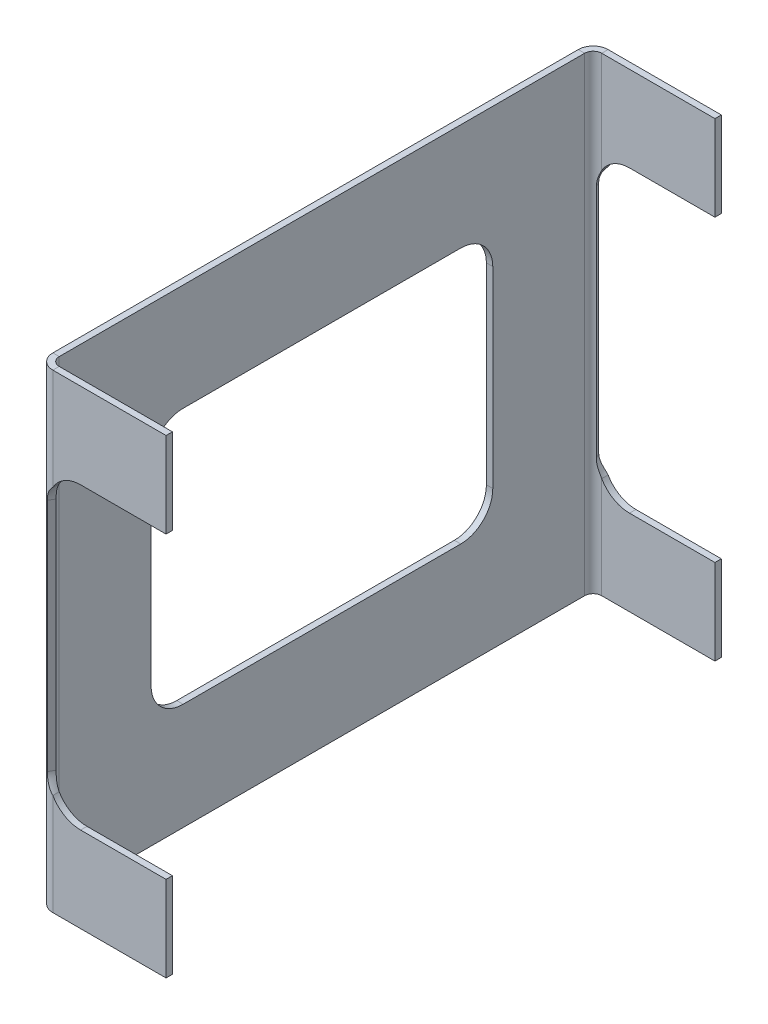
ISO-10303-21;
HEADER;
FILE_DESCRIPTION(('STEP AP214'),'2;1');
FILE_NAME('part.step','',(''),(''),'','','');
FILE_SCHEMA(('AUTOMOTIVE_DESIGN { 1 0 10303 214 1 1 1 1 }'));
ENDSEC;
DATA;
#1=APPLICATION_CONTEXT('core data for automotive mechanical design processes');
#2=APPLICATION_PROTOCOL_DEFINITION('international standard','automotive_design',2000,#1);
#3=PRODUCT_CONTEXT('',#1,'mechanical');
#4=PRODUCT('Part','Part','',(#3));
#5=PRODUCT_RELATED_PRODUCT_CATEGORY('part','',(#4));
#6=PRODUCT_DEFINITION_FORMATION('','',#4);
#7=PRODUCT_DEFINITION_CONTEXT('part definition',#1,'design');
#8=PRODUCT_DEFINITION('design','',#6,#7);
#9=PRODUCT_DEFINITION_SHAPE('','',#8);
#10=(LENGTH_UNIT() NAMED_UNIT(*) SI_UNIT(.MILLI.,.METRE.));
#11=(NAMED_UNIT(*) PLANE_ANGLE_UNIT() SI_UNIT($,.RADIAN.));
#12=(NAMED_UNIT(*) SI_UNIT($,.STERADIAN.) SOLID_ANGLE_UNIT());
#13=UNCERTAINTY_MEASURE_WITH_UNIT(LENGTH_MEASURE(1.E-05),#10,'distance_accuracy_value','');
#14=(GEOMETRIC_REPRESENTATION_CONTEXT(3) GLOBAL_UNCERTAINTY_ASSIGNED_CONTEXT((#13)) GLOBAL_UNIT_ASSIGNED_CONTEXT((#10,
#11,#12)) REPRESENTATION_CONTEXT('',''));
#15=CARTESIAN_POINT('',(0.,0.,0.));
#16=DIRECTION('',(0.,0.,1.));
#17=DIRECTION('',(1.,0.,0.));
#18=AXIS2_PLACEMENT_3D('',#15,#16,#17);
#19=CARTESIAN_POINT('',(4.43738000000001,69.85,78.11262));
#20=DIRECTION('',(0.,-1.,0.));
#21=DIRECTION('',(0.,0.,-1.));
#22=AXIS2_PLACEMENT_3D('',#19,#20,#21);
#23=CYLINDRICAL_SURFACE('',#22,4.43738);
#24=DIRECTION('',(0.,-1.,0.));
#25=VECTOR('',#24,1.);
#26=CARTESIAN_POINT('',(2.23200214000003,69.85,81.9631588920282));
#27=LINE('',#26,#25);
#28=CARTESIAN_POINT('',(2.23200214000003,34.925,81.9631588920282));
#29=VERTEX_POINT('',#28);
#30=CARTESIAN_POINT('',(2.23200214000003,-34.925,81.9631588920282));
#31=VERTEX_POINT('',#30);
#32=EDGE_CURVE('E319',#29,#31,#27,.T.);
#33=ORIENTED_EDGE('',*,*,#32,.F.);
#34=CARTESIAN_POINT('',(4.43738000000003,39.663642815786,82.55));
#35=CARTESIAN_POINT('',(4.36605152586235,39.5924532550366,82.5500013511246));
#36=CARTESIAN_POINT('',(4.29579819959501,39.520210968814,82.548279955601));
#37=CARTESIAN_POINT('',(4.15766612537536,39.373645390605,82.5417146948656));
#38=CARTESIAN_POINT('',(4.08978706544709,39.2993223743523,82.5368712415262));
#39=CARTESIAN_POINT('',(3.89007639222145,39.0733043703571,82.518146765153));
#40=CARTESIAN_POINT('',(3.76211029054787,38.9184998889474,82.5000710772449));
#41=CARTESIAN_POINT('',(3.51686311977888,38.5993025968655,82.4552795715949));
#42=CARTESIAN_POINT('',(3.39970629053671,38.4348271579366,82.4284763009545));
#43=CARTESIAN_POINT('',(3.17915467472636,38.0978288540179,82.3694069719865));
#44=CARTESIAN_POINT('',(3.07575812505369,37.925307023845,82.337141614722));
#45=CARTESIAN_POINT('',(2.90184423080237,37.6045964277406,82.2766728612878));
#46=CARTESIAN_POINT('',(2.82877187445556,37.4577263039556,82.2488054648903));
#47=CARTESIAN_POINT('',(2.69382715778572,37.1587667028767,82.1937565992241));
#48=CARTESIAN_POINT('',(2.6319551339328,37.0066770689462,82.1665751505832));
#49=CARTESIAN_POINT('',(2.52079294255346,36.6986705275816,82.1152145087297));
#50=CARTESIAN_POINT('',(2.47141792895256,36.5427877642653,82.0910156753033));
#51=CARTESIAN_POINT('',(2.38580262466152,36.2268485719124,82.0475511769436));
#52=CARTESIAN_POINT('',(2.34955462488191,36.0667946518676,82.0282826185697));
#53=CARTESIAN_POINT('',(2.29131720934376,35.7444180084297,81.9966724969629));
#54=CARTESIAN_POINT('',(2.26923988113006,35.5821157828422,81.9842882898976));
#55=CARTESIAN_POINT('',(2.24698574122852,35.3369641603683,81.9717104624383));
#56=CARTESIAN_POINT('',(2.24137767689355,35.254726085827,81.968517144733));
#57=CARTESIAN_POINT('',(2.2338840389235,35.0899975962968,81.9642373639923));
#58=CARTESIAN_POINT('',(2.23199976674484,35.0075071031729,81.9631516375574));
#59=CARTESIAN_POINT('',(2.23200214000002,34.925,81.9631588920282));
#60=B_SPLINE_CURVE_WITH_KNOTS('',3,(#34,#35,#36,#37,#38,#39,#40,#41,#42,#43,#44,#45,#46,#47,#48,
#49,#50,#51,#52,#53,#54,#55,#56,#57,#58,#59),.UNSPECIFIED.,.F.,.F.,(4,2,2,2,2,2,2,2,2,2,2,2,4),
(0.,0.302269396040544,0.604498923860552,1.2087010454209,1.81915401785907,2.42952869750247,
2.92829909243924,3.42708446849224,3.92238665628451,4.4173974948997,4.90930690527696,
5.15668167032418,5.40414287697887),.UNSPECIFIED.);
#61=CARTESIAN_POINT('',(4.43738000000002,39.663642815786,82.55));
#62=VERTEX_POINT('',#61);
#63=EDGE_CURVE('E321',#62,#29,#60,.T.);
#64=ORIENTED_EDGE('',*,*,#63,.F.);
#65=DIRECTION('',(0.,-1.,0.));
#66=VECTOR('',#65,1.);
#67=CARTESIAN_POINT('',(4.43738000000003,69.85,82.55));
#68=LINE('',#67,#66);
#69=CARTESIAN_POINT('',(4.43738000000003,69.85,82.55));
#70=VERTEX_POINT('',#69);
#71=EDGE_CURVE('E610',#70,#62,#68,.T.);
#72=ORIENTED_EDGE('',*,*,#71,.F.);
#73=CARTESIAN_POINT('',(4.43738000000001,69.85,78.11262));
#74=DIRECTION('',(0.,1.,0.));
#75=DIRECTION('',(0.,0.,1.));
#76=AXIS2_PLACEMENT_3D('',#73,#74,#75);
#77=CIRCLE('',#76,4.43738);
#78=CARTESIAN_POINT('',(0.,69.85,78.11262));
#79=VERTEX_POINT('',#78);
#80=EDGE_CURVE('E599',#70,#79,#77,.F.);
#81=ORIENTED_EDGE('',*,*,#80,.T.);
#82=DIRECTION('',(0.,-1.,0.));
#83=VECTOR('',#82,1.);
#84=CARTESIAN_POINT('',(0.,69.85,78.11262));
#85=LINE('',#84,#83);
#86=CARTESIAN_POINT('',(0.,-69.85,78.11262));
#87=VERTEX_POINT('',#86);
#88=EDGE_CURVE('E606',#79,#87,#85,.T.);
#89=ORIENTED_EDGE('',*,*,#88,.T.);
#90=CARTESIAN_POINT('',(4.43738000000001,-69.85,78.11262));
#91=DIRECTION('',(0.,1.,0.));
#92=DIRECTION('',(0.,0.,1.));
#93=AXIS2_PLACEMENT_3D('',#90,#91,#92);
#94=CIRCLE('',#93,4.43738);
#95=CARTESIAN_POINT('',(4.43738000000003,-69.85,82.55));
#96=VERTEX_POINT('',#95);
#97=EDGE_CURVE('E647',#96,#87,#94,.F.);
#98=ORIENTED_EDGE('',*,*,#97,.F.);
#99=CARTESIAN_POINT('',(4.43738000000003,-39.663642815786,82.55));
#100=VERTEX_POINT('',#99);
#101=EDGE_CURVE('E690',#100,#96,#68,.T.);
#102=ORIENTED_EDGE('',*,*,#101,.F.);
#103=CARTESIAN_POINT('',(2.23200214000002,-34.925,81.9631588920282));
#104=CARTESIAN_POINT('',(2.23200113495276,-34.9936685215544,81.9631555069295));
#105=CARTESIAN_POINT('',(2.23330557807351,-35.0623276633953,81.9639057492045));
#106=CARTESIAN_POINT('',(2.23850103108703,-35.1995098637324,81.9668755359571));
#107=CARTESIAN_POINT('',(2.24239179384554,-35.2680329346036,81.9690949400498));
#108=CARTESIAN_POINT('',(2.25789196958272,-35.4730370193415,81.9778914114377));
#109=CARTESIAN_POINT('',(2.27332942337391,-35.6091591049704,81.9866069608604));
#110=CARTESIAN_POINT('',(2.31389168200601,-35.8782147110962,82.0089853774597));
#111=CARTESIAN_POINT('',(2.33892592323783,-36.011166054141,82.0226019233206));
#112=CARTESIAN_POINT('',(2.39823137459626,-36.2745454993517,82.0538551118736));
#113=CARTESIAN_POINT('',(2.43250626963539,-36.4049725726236,82.0714933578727));
#114=CARTESIAN_POINT('',(2.5242584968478,-36.7114174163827,82.1168453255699));
#115=CARTESIAN_POINT('',(2.58561180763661,-36.8860877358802,82.1458507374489));
#116=CARTESIAN_POINT('',(2.72323407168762,-37.229030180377,82.2062349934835));
#117=CARTESIAN_POINT('',(2.79950900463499,-37.3972997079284,82.2376147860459));
#118=CARTESIAN_POINT('',(2.96591817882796,-37.727875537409,82.2998700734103));
#119=CARTESIAN_POINT('',(3.0561118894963,-37.8901523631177,82.3307427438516));
#120=CARTESIAN_POINT('',(3.2487667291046,-38.2077899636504,82.3890293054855));
#121=CARTESIAN_POINT('',(3.35122421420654,-38.3631527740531,82.4164442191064));
#122=CARTESIAN_POINT('',(3.60471782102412,-38.7197459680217,82.4737224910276));
#123=CARTESIAN_POINT('',(3.76027995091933,-38.9182018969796,82.5011388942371));
#124=CARTESIAN_POINT('',(4.00587133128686,-39.2056172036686,82.5297354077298));
#125=CARTESIAN_POINT('',(4.08954430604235,-39.2994811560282,82.5371763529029));
#126=CARTESIAN_POINT('',(4.26070568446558,-39.4839919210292,82.5473104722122));
#127=CARTESIAN_POINT('',(4.34819550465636,-39.5746375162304,82.5500018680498));
#128=CARTESIAN_POINT('',(4.43738000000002,-39.663642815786,82.55));
#129=B_SPLINE_CURVE_WITH_KNOTS('',3,(#103,#104,#105,#106,#107,#108,#109,#110,#111,#112,#113,
#114,#115,#116,#117,#118,#119,#120,#121,#122,#123,#124,#125,#126,#127,#128),.UNSPECIFIED.,.F.,
.F.,(4,2,2,2,2,2,2,2,2,2,2,2,4),(0.,0.205971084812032,0.411922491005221,0.823208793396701,
1.23070576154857,1.63836546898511,2.19969491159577,2.76124976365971,3.32527397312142,
3.88913101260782,4.64849546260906,5.02622795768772,5.40410185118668),.UNSPECIFIED.);
#130=EDGE_CURVE('E322',#31,#100,#129,.T.);
#131=ORIENTED_EDGE('',*,*,#130,.F.);
#132=EDGE_LOOP('',(#33,#64,#72,#81,#89,#98,#102,#131));
#133=FACE_BOUND('',#132,.T.);
#134=ADVANCED_FACE('F36',(#133),#23,.T.);
#135=CARTESIAN_POINT('',(38.1,69.85,82.55));
#136=DIRECTION('',(0.,0.,1.));
#137=DIRECTION('',(1.,0.,0.));
#138=AXIS2_PLACEMENT_3D('',#135,#136,#137);
#139=PLANE('',#138);
#140=ORIENTED_EDGE('',*,*,#71,.T.);
#141=CARTESIAN_POINT('',(12.7,34.925,82.55));
#142=DIRECTION('',(0.,0.,1.));
#143=DIRECTION('',(1.,0.,0.));
#144=AXIS2_PLACEMENT_3D('',#141,#142,#143);
#145=CIRCLE('',#144,9.525);
#146=CARTESIAN_POINT('',(12.7,44.45,82.55));
#147=VERTEX_POINT('',#146);
#148=EDGE_CURVE('E468',#147,#62,#145,.T.);
#149=ORIENTED_EDGE('',*,*,#148,.F.);
#150=DIRECTION('',(1.,0.,0.));
#151=VECTOR('',#150,1.);
#152=CARTESIAN_POINT('',(38.1,44.45,82.55));
#153=LINE('',#152,#151);
#154=CARTESIAN_POINT('',(38.1,44.45,82.55));
#155=VERTEX_POINT('',#154);
#156=EDGE_CURVE('E441',#155,#147,#153,.F.);
#157=ORIENTED_EDGE('',*,*,#156,.F.);
#158=DIRECTION('',(0.,-1.,0.));
#159=VECTOR('',#158,1.);
#160=CARTESIAN_POINT('',(38.1,69.85,82.55));
#161=LINE('',#160,#159);
#162=CARTESIAN_POINT('',(38.1,69.85,82.55));
#163=VERTEX_POINT('',#162);
#164=EDGE_CURVE('E687',#163,#155,#161,.T.);
#165=ORIENTED_EDGE('',*,*,#164,.F.);
#166=DIRECTION('',(-1.,0.,0.));
#167=VECTOR('',#166,1.);
#168=CARTESIAN_POINT('',(38.1,69.85,82.55));
#169=LINE('',#168,#167);
#170=EDGE_CURVE('E612',#163,#70,#169,.T.);
#171=ORIENTED_EDGE('',*,*,#170,.T.);
#172=EDGE_LOOP('',(#140,#149,#157,#165,#171));
#173=FACE_BOUND('',#172,.T.);
#174=ADVANCED_FACE('F522',(#173),#139,.T.);
#175=CARTESIAN_POINT('',(38.1,-44.45,82.55));
#176=VERTEX_POINT('',#175);
#177=CARTESIAN_POINT('',(38.1,-69.85,82.55));
#178=VERTEX_POINT('',#177);
#179=EDGE_CURVE('E686',#176,#178,#161,.T.);
#180=ORIENTED_EDGE('',*,*,#179,.F.);
#181=DIRECTION('',(1.,0.,0.));
#182=VECTOR('',#181,1.);
#183=CARTESIAN_POINT('',(38.1,-44.45,82.55));
#184=LINE('',#183,#182);
#185=CARTESIAN_POINT('',(12.7,-44.45,82.55));
#186=VERTEX_POINT('',#185);
#187=EDGE_CURVE('E457',#186,#176,#184,.T.);
#188=ORIENTED_EDGE('',*,*,#187,.F.);
#189=CARTESIAN_POINT('',(12.7,-34.925,82.55));
#190=DIRECTION('',(0.,0.,1.));
#191=DIRECTION('',(1.,0.,0.));
#192=AXIS2_PLACEMENT_3D('',#189,#190,#191);
#193=CIRCLE('',#192,9.525);
#194=EDGE_CURVE('E466',#100,#186,#193,.T.);
#195=ORIENTED_EDGE('',*,*,#194,.F.);
#196=ORIENTED_EDGE('',*,*,#101,.T.);
#197=DIRECTION('',(-1.,0.,0.));
#198=VECTOR('',#197,1.);
#199=CARTESIAN_POINT('',(38.1,-69.85,82.55));
#200=LINE('',#199,#198);
#201=EDGE_CURVE('E650',#178,#96,#200,.T.);
#202=ORIENTED_EDGE('',*,*,#201,.F.);
#203=EDGE_LOOP('',(#180,#188,#195,#196,#202));
#204=FACE_BOUND('',#203,.T.);
#205=ADVANCED_FACE('F528',(#204),#139,.T.);
#206=CARTESIAN_POINT('',(38.1,69.85,80.65262));
#207=DIRECTION('',(1.,0.,0.));
#208=DIRECTION('',(0.,0.,-1.));
#209=AXIS2_PLACEMENT_3D('',#206,#207,#208);
#210=PLANE('',#209);
#211=ORIENTED_EDGE('',*,*,#164,.T.);
#212=DIRECTION('',(0.,0.,-1.));
#213=VECTOR('',#212,1.);
#214=CARTESIAN_POINT('',(38.1,44.45,80.65262));
#215=LINE('',#214,#213);
#216=CARTESIAN_POINT('',(38.1,44.45,80.65262));
#217=VERTEX_POINT('',#216);
#218=EDGE_CURVE('E450',#217,#155,#215,.F.);
#219=ORIENTED_EDGE('',*,*,#218,.F.);
#220=DIRECTION('',(0.,-1.,0.));
#221=VECTOR('',#220,1.);
#222=CARTESIAN_POINT('',(38.1,69.85,80.65262));
#223=LINE('',#222,#221);
#224=CARTESIAN_POINT('',(38.1,69.85,80.65262));
#225=VERTEX_POINT('',#224);
#226=EDGE_CURVE('E683',#225,#217,#223,.T.);
#227=ORIENTED_EDGE('',*,*,#226,.F.);
#228=DIRECTION('',(0.,0.,1.));
#229=VECTOR('',#228,1.);
#230=CARTESIAN_POINT('',(38.1,69.85,80.65262));
#231=LINE('',#230,#229);
#232=EDGE_CURVE('E614',#225,#163,#231,.T.);
#233=ORIENTED_EDGE('',*,*,#232,.T.);
#234=EDGE_LOOP('',(#211,#219,#227,#233));
#235=FACE_BOUND('',#234,.T.);
#236=ADVANCED_FACE('F859',(#235),#210,.T.);
#237=CARTESIAN_POINT('',(38.1,-44.45,80.65262));
#238=VERTEX_POINT('',#237);
#239=CARTESIAN_POINT('',(38.1,-69.85,80.65262));
#240=VERTEX_POINT('',#239);
#241=EDGE_CURVE('E682',#238,#240,#223,.T.);
#242=ORIENTED_EDGE('',*,*,#241,.F.);
#243=DIRECTION('',(0.,0.,-1.));
#244=VECTOR('',#243,1.);
#245=CARTESIAN_POINT('',(38.1,-44.45,80.65262));
#246=LINE('',#245,#244);
#247=EDGE_CURVE('E440',#238,#176,#246,.F.);
#248=ORIENTED_EDGE('',*,*,#247,.T.);
#249=ORIENTED_EDGE('',*,*,#179,.T.);
#250=DIRECTION('',(0.,0.,1.));
#251=VECTOR('',#250,1.);
#252=CARTESIAN_POINT('',(38.1,-69.85,80.65262));
#253=LINE('',#252,#251);
#254=EDGE_CURVE('E653',#240,#178,#253,.T.);
#255=ORIENTED_EDGE('',*,*,#254,.F.);
#256=EDGE_LOOP('',(#242,#248,#249,#255));
#257=FACE_BOUND('',#256,.T.);
#258=ADVANCED_FACE('F857',(#257),#210,.T.);
#259=CARTESIAN_POINT('',(38.1,69.85,80.65262));
#260=DIRECTION('',(0.,0.,1.));
#261=DIRECTION('',(1.,0.,0.));
#262=AXIS2_PLACEMENT_3D('',#259,#260,#261);
#263=PLANE('',#262);
#264=CARTESIAN_POINT('',(12.7,34.925,80.65262));
#265=DIRECTION('',(0.,0.,1.));
#266=DIRECTION('',(1.,0.,0.));
#267=AXIS2_PLACEMENT_3D('',#264,#265,#266);
#268=CIRCLE('',#267,9.525);
#269=CARTESIAN_POINT('',(12.7,44.45,80.65262));
#270=VERTEX_POINT('',#269);
#271=CARTESIAN_POINT('',(4.43738000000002,39.663642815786,80.65262));
#272=VERTEX_POINT('',#271);
#273=EDGE_CURVE('E458',#270,#272,#268,.T.);
#274=ORIENTED_EDGE('',*,*,#273,.T.);
#275=DIRECTION('',(0.,-1.,0.));
#276=VECTOR('',#275,1.);
#277=CARTESIAN_POINT('',(4.43738000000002,69.85,80.65262));
#278=LINE('',#277,#276);
#279=CARTESIAN_POINT('',(4.43738000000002,69.85,80.65262));
#280=VERTEX_POINT('',#279);
#281=EDGE_CURVE('E679',#280,#272,#278,.T.);
#282=ORIENTED_EDGE('',*,*,#281,.F.);
#283=DIRECTION('',(-1.,0.,0.));
#284=VECTOR('',#283,1.);
#285=CARTESIAN_POINT('',(38.1,69.85,80.65262));
#286=LINE('',#285,#284);
#287=EDGE_CURVE('E620',#225,#280,#286,.T.);
#288=ORIENTED_EDGE('',*,*,#287,.F.);
#289=ORIENTED_EDGE('',*,*,#226,.T.);
#290=DIRECTION('',(-1.,0.,0.));
#291=VECTOR('',#290,1.);
#292=CARTESIAN_POINT('',(38.1,44.45,80.65262));
#293=LINE('',#292,#291);
#294=EDGE_CURVE('E454',#217,#270,#293,.T.);
#295=ORIENTED_EDGE('',*,*,#294,.T.);
#296=EDGE_LOOP('',(#274,#282,#288,#289,#295));
#297=FACE_BOUND('',#296,.T.);
#298=ADVANCED_FACE('F855',(#297),#263,.F.);
#299=DIRECTION('',(1.,0.,0.));
#300=VECTOR('',#299,1.);
#301=CARTESIAN_POINT('',(38.1,-44.45,80.65262));
#302=LINE('',#301,#300);
#303=CARTESIAN_POINT('',(12.7,-44.45,80.65262));
#304=VERTEX_POINT('',#303);
#305=EDGE_CURVE('E330',#304,#238,#302,.T.);
#306=ORIENTED_EDGE('',*,*,#305,.T.);
#307=ORIENTED_EDGE('',*,*,#241,.T.);
#308=DIRECTION('',(-1.,0.,0.));
#309=VECTOR('',#308,1.);
#310=CARTESIAN_POINT('',(38.1,-69.85,80.65262));
#311=LINE('',#310,#309);
#312=CARTESIAN_POINT('',(4.43738000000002,-69.85,80.65262));
#313=VERTEX_POINT('',#312);
#314=EDGE_CURVE('E656',#240,#313,#311,.T.);
#315=ORIENTED_EDGE('',*,*,#314,.T.);
#316=CARTESIAN_POINT('',(4.43738000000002,-39.663642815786,80.65262));
#317=VERTEX_POINT('',#316);
#318=EDGE_CURVE('E678',#317,#313,#278,.T.);
#319=ORIENTED_EDGE('',*,*,#318,.F.);
#320=CARTESIAN_POINT('',(12.7,-34.925,80.65262));
#321=DIRECTION('',(0.,0.,1.));
#322=DIRECTION('',(1.,0.,0.));
#323=AXIS2_PLACEMENT_3D('',#320,#321,#322);
#324=CIRCLE('',#323,9.525);
#325=EDGE_CURVE('E461',#317,#304,#324,.T.);
#326=ORIENTED_EDGE('',*,*,#325,.T.);
#327=EDGE_LOOP('',(#306,#307,#315,#319,#326));
#328=FACE_BOUND('',#327,.T.);
#329=ADVANCED_FACE('F853',(#328),#263,.F.);
#330=CARTESIAN_POINT('',(4.43738000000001,69.85,78.11262));
#331=DIRECTION('',(0.,-1.,0.));
#332=DIRECTION('',(0.,0.,-1.));
#333=AXIS2_PLACEMENT_3D('',#330,#331,#332);
#334=CYLINDRICAL_SURFACE('',#333,2.54);
#335=CARTESIAN_POINT('',(4.43738000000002,39.663642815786,80.65262));
#336=CARTESIAN_POINT('',(4.37864998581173,39.561256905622,80.6526107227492));
#337=CARTESIAN_POINT('',(4.32184535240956,39.4578055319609,80.6505843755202));
#338=CARTESIAN_POINT('',(4.21218538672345,39.2489902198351,80.643215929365));
#339=CARTESIAN_POINT('',(4.15932863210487,39.1436269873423,80.6378750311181));
#340=CARTESIAN_POINT('',(4.0068992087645,38.8251623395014,80.6179720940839));
#341=CARTESIAN_POINT('',(3.91331340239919,38.6094172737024,80.5995260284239));
#342=CARTESIAN_POINT('',(3.74258644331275,38.172376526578,80.5573242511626));
#343=CARTESIAN_POINT('',(3.66542563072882,37.9510878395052,80.5335749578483));
#344=CARTESIAN_POINT('',(3.56209839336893,37.6154075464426,80.4973234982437));
#345=CARTESIAN_POINT('',(3.52971881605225,37.5028626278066,80.4851321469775));
#346=CARTESIAN_POINT('',(3.46911822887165,37.2766103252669,80.4610519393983));
#347=CARTESIAN_POINT('',(3.44089769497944,37.1629028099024,80.4491631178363));
#348=CARTESIAN_POINT('',(3.37514764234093,36.8753880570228,80.4202469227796));
#349=CARTESIAN_POINT('',(3.34034615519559,36.7008954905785,80.403739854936));
#350=CARTESIAN_POINT('',(3.28052108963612,36.3499550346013,80.3741221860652));
#351=CARTESIAN_POINT('',(3.25549759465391,36.1735071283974,80.3610116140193));
#352=CARTESIAN_POINT('',(3.21535128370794,35.8187839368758,80.3394503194));
#353=CARTESIAN_POINT('',(3.20025047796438,35.6405054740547,80.3310099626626));
#354=CARTESIAN_POINT('',(3.18511846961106,35.3725218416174,80.322477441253));
#355=CARTESIAN_POINT('',(3.18132766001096,35.2830772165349,80.3203212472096));
#356=CARTESIAN_POINT('',(3.17626856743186,35.1040907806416,80.3174335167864));
#357=CARTESIAN_POINT('',(3.17500037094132,35.0145489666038,80.3167020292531));
#358=CARTESIAN_POINT('',(3.17500000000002,34.925,80.3167063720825));
#359=B_SPLINE_CURVE_WITH_KNOTS('',3,(#335,#336,#337,#338,#339,#340,#341,#342,#343,#344,#345,
#346,#347,#348,#349,#350,#351,#352,#353,#354,#355,#356,#357,#358),.UNSPECIFIED.,.F.,.F.,(4,2,2,
2,2,2,2,2,2,2,2,4),(0.,0.354011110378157,0.707894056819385,1.41473417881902,2.12072343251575,
2.47388442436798,2.82708580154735,3.36285208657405,3.89862294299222,4.43557825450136,
4.70419020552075,4.97281136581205),.UNSPECIFIED.);
#360=CARTESIAN_POINT('',(3.17500000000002,34.925,80.3167063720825));
#361=VERTEX_POINT('',#360);
#362=EDGE_CURVE('E326',#272,#361,#359,.T.);
#363=ORIENTED_EDGE('',*,*,#362,.T.);
#364=DIRECTION('',(0.,-1.,0.));
#365=VECTOR('',#364,1.);
#366=CARTESIAN_POINT('',(3.17500000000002,69.85,80.3167063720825));
#367=LINE('',#366,#365);
#368=CARTESIAN_POINT('',(3.17500000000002,-34.925,80.3167063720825));
#369=VERTEX_POINT('',#368);
#370=EDGE_CURVE('E323',#361,#369,#367,.T.);
#371=ORIENTED_EDGE('',*,*,#370,.T.);
#372=CARTESIAN_POINT('',(3.17500000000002,-34.925,80.3167063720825));
#373=CARTESIAN_POINT('',(3.17500165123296,-35.0453289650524,80.3166880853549));
#374=CARTESIAN_POINT('',(3.17729055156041,-35.1656530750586,80.3180178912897));
#375=CARTESIAN_POINT('',(3.18641570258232,-35.4060581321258,80.3232167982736));
#376=CARTESIAN_POINT('',(3.19325133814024,-35.5261391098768,80.327085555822));
#377=CARTESIAN_POINT('',(3.21142945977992,-35.7656809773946,80.3371981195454));
#378=CARTESIAN_POINT('',(3.22276530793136,-35.885142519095,80.3434384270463));
#379=CARTESIAN_POINT('',(3.24993135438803,-36.1234215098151,80.3580155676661));
#380=CARTESIAN_POINT('',(3.26576171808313,-36.2422389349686,80.3663524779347));
#381=CARTESIAN_POINT('',(3.31990618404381,-36.5973507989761,80.3939608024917));
#382=CARTESIAN_POINT('',(3.36488531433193,-36.8324575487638,80.4158371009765));
#383=CARTESIAN_POINT('',(3.47233325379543,-37.29840056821,80.4628773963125));
#384=CARTESIAN_POINT('',(3.534811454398,-37.5292344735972,80.4880431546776));
#385=CARTESIAN_POINT('',(3.65735506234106,-37.9226836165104,80.5304956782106));
#386=CARTESIAN_POINT('',(3.71333280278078,-38.086553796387,80.5480410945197));
#387=CARTESIAN_POINT('',(3.83422310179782,-38.4112034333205,80.5807618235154));
#388=CARTESIAN_POINT('',(3.89913498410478,-38.5719831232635,80.5959373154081));
#389=CARTESIAN_POINT('',(4.03786558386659,-38.8902746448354,80.6219980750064));
#390=CARTESIAN_POINT('',(4.11169488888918,-39.0477823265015,80.6328781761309));
#391=CARTESIAN_POINT('',(4.22896505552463,-39.2810481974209,80.6443595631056));
#392=CARTESIAN_POINT('',(4.26915884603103,-39.3583321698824,80.6473804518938));
#393=CARTESIAN_POINT('',(4.35168053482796,-39.5118198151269,80.6515095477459));
#394=CARTESIAN_POINT('',(4.3940087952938,-39.5880233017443,80.6526174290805));
#395=CARTESIAN_POINT('',(4.43738000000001,-39.663642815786,80.65262));
#396=B_SPLINE_CURVE_WITH_KNOTS('',3,(#372,#373,#374,#375,#376,#377,#378,#379,#380,#381,#382,
#383,#384,#385,#386,#387,#388,#389,#390,#391,#392,#393,#394,#395),.UNSPECIFIED.,.F.,.F.,(4,2,2,
2,2,2,2,2,2,2,2,4),(0.,0.360949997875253,0.721851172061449,1.08222197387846,1.44260603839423,
2.16291553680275,2.88361235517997,3.40552590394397,3.9273999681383,4.44989985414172,
4.71134276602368,4.97283018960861),.UNSPECIFIED.);
#397=EDGE_CURVE('E308',#369,#317,#396,.T.);
#398=ORIENTED_EDGE('',*,*,#397,.T.);
#399=ORIENTED_EDGE('',*,*,#318,.T.);
#400=CARTESIAN_POINT('',(4.43738000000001,-69.85,78.11262));
#401=DIRECTION('',(0.,1.,0.));
#402=DIRECTION('',(1.,0.,0.));
#403=AXIS2_PLACEMENT_3D('',#400,#401,#402);
#404=CIRCLE('',#403,2.54);
#405=CARTESIAN_POINT('',(1.89738,-69.85,78.11262));
#406=VERTEX_POINT('',#405);
#407=EDGE_CURVE('E659',#313,#406,#404,.F.);
#408=ORIENTED_EDGE('',*,*,#407,.T.);
#409=DIRECTION('',(0.,-1.,0.));
#410=VECTOR('',#409,1.);
#411=CARTESIAN_POINT('',(1.89738,69.85,78.11262));
#412=LINE('',#411,#410);
#413=CARTESIAN_POINT('',(1.89738,69.85,78.11262));
#414=VERTEX_POINT('',#413);
#415=EDGE_CURVE('E675',#414,#406,#412,.T.);
#416=ORIENTED_EDGE('',*,*,#415,.F.);
#417=CARTESIAN_POINT('',(4.43738000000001,69.85,78.11262));
#418=DIRECTION('',(0.,1.,0.));
#419=DIRECTION('',(1.,0.,0.));
#420=AXIS2_PLACEMENT_3D('',#417,#418,#419);
#421=CIRCLE('',#420,2.54);
#422=EDGE_CURVE('E623',#280,#414,#421,.F.);
#423=ORIENTED_EDGE('',*,*,#422,.F.);
#424=ORIENTED_EDGE('',*,*,#281,.T.);
#425=EDGE_LOOP('',(#363,#371,#398,#399,#408,#416,#423,#424));
#426=FACE_BOUND('',#425,.T.);
#427=ADVANCED_FACE('F557',(#426),#334,.F.);
#428=CARTESIAN_POINT('',(0.,69.85,-80.65262));
#429=DIRECTION('',(0.,0.,-1.));
#430=DIRECTION('',(-1.,0.,0.));
#431=AXIS2_PLACEMENT_3D('',#428,#429,#430);
#432=PLANE('',#431);
#433=DIRECTION('',(-1.,0.,0.));
#434=VECTOR('',#433,1.);
#435=CARTESIAN_POINT('',(0.,-44.45,-80.65262));
#436=LINE('',#435,#434);
#437=CARTESIAN_POINT('',(12.7,-44.45,-80.65262));
#438=VERTEX_POINT('',#437);
#439=CARTESIAN_POINT('',(38.1,-44.45,-80.65262));
#440=VERTEX_POINT('',#439);
#441=EDGE_CURVE('E827',#438,#440,#436,.F.);
#442=ORIENTED_EDGE('',*,*,#441,.F.);
#443=CARTESIAN_POINT('',(12.7,-34.925,-80.65262));
#444=DIRECTION('',(0.,0.,1.));
#445=DIRECTION('',(1.,0.,0.));
#446=AXIS2_PLACEMENT_3D('',#443,#444,#445);
#447=CIRCLE('',#446,9.525);
#448=CARTESIAN_POINT('',(4.43737999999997,-39.6636428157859,-80.65262));
#449=VERTEX_POINT('',#448);
#450=EDGE_CURVE('E412',#449,#438,#447,.T.);
#451=ORIENTED_EDGE('',*,*,#450,.F.);
#452=DIRECTION('',(0.,-1.,0.));
#453=VECTOR('',#452,1.);
#454=CARTESIAN_POINT('',(4.43737999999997,69.85,-80.65262));
#455=LINE('',#454,#453);
#456=CARTESIAN_POINT('',(4.43737999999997,-69.85,-80.65262));
#457=VERTEX_POINT('',#456);
#458=EDGE_CURVE('E630',#449,#457,#455,.T.);
#459=ORIENTED_EDGE('',*,*,#458,.T.);
#460=DIRECTION('',(1.,0.,0.));
#461=VECTOR('',#460,1.);
#462=CARTESIAN_POINT('',(0.,-69.85,-80.65262));
#463=LINE('',#462,#461);
#464=CARTESIAN_POINT('',(38.1,-69.85,-80.65262));
#465=VERTEX_POINT('',#464);
#466=EDGE_CURVE('E631',#457,#465,#463,.T.);
#467=ORIENTED_EDGE('',*,*,#466,.T.);
#468=DIRECTION('',(0.,-1.,0.));
#469=VECTOR('',#468,1.);
#470=CARTESIAN_POINT('',(38.1,69.85,-80.65262));
#471=LINE('',#470,#469);
#472=EDGE_CURVE('E703',#440,#465,#471,.T.);
#473=ORIENTED_EDGE('',*,*,#472,.F.);
#474=EDGE_LOOP('',(#442,#451,#459,#467,#473));
#475=FACE_BOUND('',#474,.T.);
#476=ADVANCED_FACE('F554',(#475),#432,.F.);
#477=DIRECTION('',(-1.,0.,0.));
#478=VECTOR('',#477,1.);
#479=CARTESIAN_POINT('',(0.,44.45,-80.65262));
#480=LINE('',#479,#478);
#481=CARTESIAN_POINT('',(38.1,44.45,-80.65262));
#482=VERTEX_POINT('',#481);
#483=CARTESIAN_POINT('',(12.7,44.45,-80.65262));
#484=VERTEX_POINT('',#483);
#485=EDGE_CURVE('E826',#482,#484,#480,.T.);
#486=ORIENTED_EDGE('',*,*,#485,.F.);
#487=CARTESIAN_POINT('',(38.1,69.85,-80.65262));
#488=VERTEX_POINT('',#487);
#489=EDGE_CURVE('E704',#488,#482,#471,.T.);
#490=ORIENTED_EDGE('',*,*,#489,.F.);
#491=DIRECTION('',(1.,0.,0.));
#492=VECTOR('',#491,1.);
#493=CARTESIAN_POINT('',(0.,69.85,-80.65262));
#494=LINE('',#493,#492);
#495=CARTESIAN_POINT('',(4.43737999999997,69.85,-80.65262));
#496=VERTEX_POINT('',#495);
#497=EDGE_CURVE('E668',#496,#488,#494,.T.);
#498=ORIENTED_EDGE('',*,*,#497,.F.);
#499=CARTESIAN_POINT('',(4.43737999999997,39.6636428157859,-80.65262));
#500=VERTEX_POINT('',#499);
#501=EDGE_CURVE('E669',#496,#500,#455,.T.);
#502=ORIENTED_EDGE('',*,*,#501,.T.);
#503=CARTESIAN_POINT('',(12.7,34.925,-80.65262));
#504=DIRECTION('',(0.,0.,1.));
#505=DIRECTION('',(1.,0.,0.));
#506=AXIS2_PLACEMENT_3D('',#503,#504,#505);
#507=CIRCLE('',#506,9.525);
#508=EDGE_CURVE('E794',#484,#500,#507,.T.);
#509=ORIENTED_EDGE('',*,*,#508,.F.);
#510=EDGE_LOOP('',(#486,#490,#498,#502,#509));
#511=FACE_BOUND('',#510,.T.);
#512=ADVANCED_FACE('F552',(#511),#432,.F.);
#513=CARTESIAN_POINT('',(38.1,69.85,-82.55));
#514=DIRECTION('',(1.,0.,0.));
#515=DIRECTION('',(0.,0.,-1.));
#516=AXIS2_PLACEMENT_3D('',#513,#514,#515);
#517=PLANE('',#516);
#518=ORIENTED_EDGE('',*,*,#489,.T.);
#519=DIRECTION('',(0.,0.,-1.));
#520=VECTOR('',#519,1.);
#521=CARTESIAN_POINT('',(38.1,44.45,-82.55));
#522=LINE('',#521,#520);
#523=CARTESIAN_POINT('',(38.1,44.45,-82.55));
#524=VERTEX_POINT('',#523);
#525=EDGE_CURVE('E814',#524,#482,#522,.F.);
#526=ORIENTED_EDGE('',*,*,#525,.F.);
#527=DIRECTION('',(0.,-1.,0.));
#528=VECTOR('',#527,1.);
#529=CARTESIAN_POINT('',(38.1,69.85,-82.55));
#530=LINE('',#529,#528);
#531=CARTESIAN_POINT('',(38.1,69.85,-82.55));
#532=VERTEX_POINT('',#531);
#533=EDGE_CURVE('E700',#532,#524,#530,.T.);
#534=ORIENTED_EDGE('',*,*,#533,.F.);
#535=DIRECTION('',(0.,0.,1.));
#536=VECTOR('',#535,1.);
#537=CARTESIAN_POINT('',(38.1,69.85,-82.55));
#538=LINE('',#537,#536);
#539=EDGE_CURVE('E807',#532,#488,#538,.T.);
#540=ORIENTED_EDGE('',*,*,#539,.T.);
#541=EDGE_LOOP('',(#518,#526,#534,#540));
#542=FACE_BOUND('',#541,.T.);
#543=ADVANCED_FACE('F549',(#542),#517,.T.);
#544=CARTESIAN_POINT('',(38.1,-44.45,-82.55));
#545=VERTEX_POINT('',#544);
#546=CARTESIAN_POINT('',(38.1,-69.85,-82.55));
#547=VERTEX_POINT('',#546);
#548=EDGE_CURVE('E699',#545,#547,#530,.T.);
#549=ORIENTED_EDGE('',*,*,#548,.F.);
#550=DIRECTION('',(0.,0.,-1.));
#551=VECTOR('',#550,1.);
#552=CARTESIAN_POINT('',(38.1,-44.45,-82.55));
#553=LINE('',#552,#551);
#554=EDGE_CURVE('E776',#545,#440,#553,.F.);
#555=ORIENTED_EDGE('',*,*,#554,.T.);
#556=ORIENTED_EDGE('',*,*,#472,.T.);
#557=DIRECTION('',(0.,0.,1.));
#558=VECTOR('',#557,1.);
#559=CARTESIAN_POINT('',(38.1,-69.85,-82.55));
#560=LINE('',#559,#558);
#561=EDGE_CURVE('E634',#547,#465,#560,.T.);
#562=ORIENTED_EDGE('',*,*,#561,.F.);
#563=EDGE_LOOP('',(#549,#555,#556,#562));
#564=FACE_BOUND('',#563,.T.);
#565=ADVANCED_FACE('F547',(#564),#517,.T.);
#566=CARTESIAN_POINT('',(0.,69.85,-82.55));
#567=DIRECTION('',(0.,0.,-1.));
#568=DIRECTION('',(-1.,0.,0.));
#569=AXIS2_PLACEMENT_3D('',#566,#567,#568);
#570=PLANE('',#569);
#571=CARTESIAN_POINT('',(12.7,-34.925,-82.55));
#572=DIRECTION('',(0.,0.,1.));
#573=DIRECTION('',(-1.,0.,0.));
#574=AXIS2_PLACEMENT_3D('',#571,#572,#573);
#575=CIRCLE('',#574,9.525);
#576=CARTESIAN_POINT('',(4.43737999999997,-39.6636428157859,-82.55));
#577=VERTEX_POINT('',#576);
#578=CARTESIAN_POINT('',(12.7,-44.45,-82.55));
#579=VERTEX_POINT('',#578);
#580=EDGE_CURVE('E821',#577,#579,#575,.T.);
#581=ORIENTED_EDGE('',*,*,#580,.T.);
#582=DIRECTION('',(1.,0.,0.));
#583=VECTOR('',#582,1.);
#584=CARTESIAN_POINT('',(38.1,-44.45,-82.55));
#585=LINE('',#584,#583);
#586=EDGE_CURVE('E772',#579,#545,#585,.T.);
#587=ORIENTED_EDGE('',*,*,#586,.T.);
#588=ORIENTED_EDGE('',*,*,#548,.T.);
#589=DIRECTION('',(1.,0.,0.));
#590=VECTOR('',#589,1.);
#591=CARTESIAN_POINT('',(0.,-69.85,-82.55));
#592=LINE('',#591,#590);
#593=CARTESIAN_POINT('',(4.43737999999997,-69.85,-82.55));
#594=VERTEX_POINT('',#593);
#595=EDGE_CURVE('E638',#594,#547,#592,.T.);
#596=ORIENTED_EDGE('',*,*,#595,.F.);
#597=DIRECTION('',(0.,-1.,0.));
#598=VECTOR('',#597,1.);
#599=CARTESIAN_POINT('',(4.43737999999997,69.85,-82.55));
#600=LINE('',#599,#598);
#601=EDGE_CURVE('E695',#577,#594,#600,.T.);
#602=ORIENTED_EDGE('',*,*,#601,.F.);
#603=EDGE_LOOP('',(#581,#587,#588,#596,#602));
#604=FACE_BOUND('',#603,.T.);
#605=ADVANCED_FACE('F544',(#604),#570,.T.);
#606=ORIENTED_EDGE('',*,*,#533,.T.);
#607=DIRECTION('',(-1.,0.,0.));
#608=VECTOR('',#607,1.);
#609=CARTESIAN_POINT('',(38.1,44.45,-82.55));
#610=LINE('',#609,#608);
#611=CARTESIAN_POINT('',(12.7,44.45,-82.55));
#612=VERTEX_POINT('',#611);
#613=EDGE_CURVE('E802',#524,#612,#610,.T.);
#614=ORIENTED_EDGE('',*,*,#613,.T.);
#615=CARTESIAN_POINT('',(12.7,34.925,-82.55));
#616=DIRECTION('',(0.,0.,1.));
#617=DIRECTION('',(-1.,0.,0.));
#618=AXIS2_PLACEMENT_3D('',#615,#616,#617);
#619=CIRCLE('',#618,9.525);
#620=CARTESIAN_POINT('',(4.43737999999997,39.6636428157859,-82.55));
#621=VERTEX_POINT('',#620);
#622=EDGE_CURVE('E433',#612,#621,#619,.T.);
#623=ORIENTED_EDGE('',*,*,#622,.T.);
#624=CARTESIAN_POINT('',(4.43737999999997,69.85,-82.55));
#625=VERTEX_POINT('',#624);
#626=EDGE_CURVE('E696',#625,#621,#600,.T.);
#627=ORIENTED_EDGE('',*,*,#626,.F.);
#628=DIRECTION('',(1.,0.,0.));
#629=VECTOR('',#628,1.);
#630=CARTESIAN_POINT('',(0.,69.85,-82.55));
#631=LINE('',#630,#629);
#632=EDGE_CURVE('E806',#625,#532,#631,.T.);
#633=ORIENTED_EDGE('',*,*,#632,.T.);
#634=EDGE_LOOP('',(#606,#614,#623,#627,#633));
#635=FACE_BOUND('',#634,.T.);
#636=ADVANCED_FACE('F542',(#635),#570,.T.);
#637=CARTESIAN_POINT('',(4.43737999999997,69.85,-78.11262));
#638=DIRECTION('',(0.,-1.,0.));
#639=DIRECTION('',(0.,0.,-1.));
#640=AXIS2_PLACEMENT_3D('',#637,#638,#639);
#641=CYLINDRICAL_SURFACE('',#640,4.43738);
#642=DIRECTION('',(0.,-1.,0.));
#643=VECTOR('',#642,1.);
#644=CARTESIAN_POINT('',(2.23200214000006,69.85,-81.9631588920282));
#645=LINE('',#644,#643);
#646=CARTESIAN_POINT('',(2.23200214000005,-34.925,-81.9631588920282));
#647=VERTEX_POINT('',#646);
#648=CARTESIAN_POINT('',(2.23200214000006,34.925,-81.9631588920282));
#649=VERTEX_POINT('',#648);
#650=EDGE_CURVE('E427',#647,#649,#645,.F.);
#651=ORIENTED_EDGE('',*,*,#650,.F.);
#652=CARTESIAN_POINT('',(4.43737999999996,-39.6636428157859,-82.55));
#653=CARTESIAN_POINT('',(4.36605152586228,-39.5924532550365,-82.5500013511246));
#654=CARTESIAN_POINT('',(4.29579819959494,-39.5202109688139,-82.548279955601));
#655=CARTESIAN_POINT('',(4.1576661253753,-39.3736453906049,-82.5417146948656));
#656=CARTESIAN_POINT('',(4.08978706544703,-39.2993223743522,-82.5368712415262));
#657=CARTESIAN_POINT('',(3.89007639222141,-39.073304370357,-82.518146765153));
#658=CARTESIAN_POINT('',(3.76211029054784,-38.9184998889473,-82.5000710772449));
#659=CARTESIAN_POINT('',(3.51686311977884,-38.5993025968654,-82.4552795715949));
#660=CARTESIAN_POINT('',(3.39970629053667,-38.4348271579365,-82.4284763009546));
#661=CARTESIAN_POINT('',(3.17915467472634,-38.0978288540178,-82.3694069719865));
#662=CARTESIAN_POINT('',(3.07575812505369,-37.9253070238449,-82.337141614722));
#663=CARTESIAN_POINT('',(2.90184423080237,-37.6045964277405,-82.2766728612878));
#664=CARTESIAN_POINT('',(2.82877187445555,-37.4577263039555,-82.2488054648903));
#665=CARTESIAN_POINT('',(2.6938271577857,-37.1587667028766,-82.1937565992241));
#666=CARTESIAN_POINT('',(2.63195513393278,-37.0066770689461,-82.1665751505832));
#667=CARTESIAN_POINT('',(2.52079294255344,-36.6986705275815,-82.1152145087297));
#668=CARTESIAN_POINT('',(2.47141792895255,-36.5427877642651,-82.0910156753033));
#669=CARTESIAN_POINT('',(2.38580262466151,-36.2268485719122,-82.0475511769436));
#670=CARTESIAN_POINT('',(2.34955462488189,-36.0667946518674,-82.0282826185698));
#671=CARTESIAN_POINT('',(2.29131720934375,-35.7444180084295,-81.996672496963));
#672=CARTESIAN_POINT('',(2.26923988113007,-35.5821157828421,-81.9842882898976));
#673=CARTESIAN_POINT('',(2.24698574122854,-35.3369641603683,-81.9717104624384));
#674=CARTESIAN_POINT('',(2.24137767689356,-35.2547260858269,-81.968517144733));
#675=CARTESIAN_POINT('',(2.23388403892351,-35.0899975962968,-81.9642373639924));
#676=CARTESIAN_POINT('',(2.23199976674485,-35.0075071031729,-81.9631516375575));
#677=CARTESIAN_POINT('',(2.23200214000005,-34.925,-81.9631588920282));
#678=B_SPLINE_CURVE_WITH_KNOTS('',3,(#652,#653,#654,#655,#656,#657,#658,#659,#660,#661,#662,
#663,#664,#665,#666,#667,#668,#669,#670,#671,#672,#673,#674,#675,#676,#677),.UNSPECIFIED.,.F.,
.F.,(4,2,2,2,2,2,2,2,2,2,2,2,4),(0.,0.302269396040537,0.604498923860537,1.20870104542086,
1.81915401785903,2.42952869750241,2.92829909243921,3.42708446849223,3.92238665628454,
4.41739749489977,4.90930690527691,5.15668167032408,5.40414287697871),.UNSPECIFIED.);
#679=EDGE_CURVE('E421',#577,#647,#678,.T.);
#680=ORIENTED_EDGE('',*,*,#679,.F.);
#681=ORIENTED_EDGE('',*,*,#601,.T.);
#682=CARTESIAN_POINT('',(4.43737999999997,-69.85,-78.11262));
#683=DIRECTION('',(0.,1.,0.));
#684=DIRECTION('',(0.,0.,1.));
#685=AXIS2_PLACEMENT_3D('',#682,#683,#684);
#686=CIRCLE('',#685,4.43738);
#687=CARTESIAN_POINT('',(0.,-69.85,-78.11262));
#688=VERTEX_POINT('',#687);
#689=EDGE_CURVE('E641',#688,#594,#686,.F.);
#690=ORIENTED_EDGE('',*,*,#689,.F.);
#691=DIRECTION('',(0.,-1.,0.));
#692=VECTOR('',#691,1.);
#693=CARTESIAN_POINT('',(0.,69.85,-78.11262));
#694=LINE('',#693,#692);
#695=CARTESIAN_POINT('',(0.,69.85,-78.11262));
#696=VERTEX_POINT('',#695);
#697=EDGE_CURVE('E693',#696,#688,#694,.T.);
#698=ORIENTED_EDGE('',*,*,#697,.F.);
#699=CARTESIAN_POINT('',(4.43737999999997,69.85,-78.11262));
#700=DIRECTION('',(0.,1.,0.));
#701=DIRECTION('',(0.,0.,1.));
#702=AXIS2_PLACEMENT_3D('',#699,#700,#701);
#703=CIRCLE('',#702,4.43738);
#704=EDGE_CURVE('E600',#696,#625,#703,.F.);
#705=ORIENTED_EDGE('',*,*,#704,.T.);
#706=ORIENTED_EDGE('',*,*,#626,.T.);
#707=CARTESIAN_POINT('',(2.23200214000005,34.925,-81.9631588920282));
#708=CARTESIAN_POINT('',(2.23200113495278,34.9936685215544,-81.9631555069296));
#709=CARTESIAN_POINT('',(2.23330557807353,35.0623276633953,-81.9639057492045));
#710=CARTESIAN_POINT('',(2.23850103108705,35.1995098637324,-81.9668755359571));
#711=CARTESIAN_POINT('',(2.24239179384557,35.2680329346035,-81.9690949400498));
#712=CARTESIAN_POINT('',(2.25789196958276,35.4730370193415,-81.9778914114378));
#713=CARTESIAN_POINT('',(2.27332942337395,35.6091591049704,-81.9866069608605));
#714=CARTESIAN_POINT('',(2.31389168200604,35.8782147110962,-82.0089853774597));
#715=CARTESIAN_POINT('',(2.33892592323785,36.011166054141,-82.0226019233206));
#716=CARTESIAN_POINT('',(2.39823137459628,36.2745454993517,-82.0538551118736));
#717=CARTESIAN_POINT('',(2.43250626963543,36.4049725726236,-82.0714933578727));
#718=CARTESIAN_POINT('',(2.52425849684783,36.7114174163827,-82.1168453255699));
#719=CARTESIAN_POINT('',(2.58561180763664,36.8860877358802,-82.1458507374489));
#720=CARTESIAN_POINT('',(2.72323407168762,37.229030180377,-82.2062349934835));
#721=CARTESIAN_POINT('',(2.79950900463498,37.3972997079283,-82.2376147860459));
#722=CARTESIAN_POINT('',(2.96591817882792,37.7278755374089,-82.2998700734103));
#723=CARTESIAN_POINT('',(3.05611188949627,37.8901523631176,-82.3307427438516));
#724=CARTESIAN_POINT('',(3.24876672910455,38.2077899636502,-82.3890293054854));
#725=CARTESIAN_POINT('',(3.35122421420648,38.363152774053,-82.4164442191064));
#726=CARTESIAN_POINT('',(3.60471782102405,38.7197459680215,-82.4737224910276));
#727=CARTESIAN_POINT('',(3.76027995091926,38.9182018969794,-82.5011388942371));
#728=CARTESIAN_POINT('',(4.00587133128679,39.2056172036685,-82.5297354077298));
#729=CARTESIAN_POINT('',(4.08954430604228,39.2994811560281,-82.5371763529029));
#730=CARTESIAN_POINT('',(4.26070568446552,39.4839919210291,-82.5473104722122));
#731=CARTESIAN_POINT('',(4.3481955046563,39.5746375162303,-82.5500018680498));
#732=CARTESIAN_POINT('',(4.43737999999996,39.6636428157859,-82.55));
#733=B_SPLINE_CURVE_WITH_KNOTS('',3,(#707,#708,#709,#710,#711,#712,#713,#714,#715,#716,#717,
#718,#719,#720,#721,#722,#723,#724,#725,#726,#727,#728,#729,#730,#731,#732),.UNSPECIFIED.,.F.,
.F.,(4,2,2,2,2,2,2,2,2,2,2,2,4),(0.,0.205971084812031,0.411922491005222,0.823208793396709,
1.23070576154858,1.63836546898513,2.19969491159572,2.76124976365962,3.32527397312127,
3.88913101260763,4.6484954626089,5.02622795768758,5.40410185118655),.UNSPECIFIED.);
#734=EDGE_CURVE('E391',#649,#621,#733,.T.);
#735=ORIENTED_EDGE('',*,*,#734,.F.);
#736=EDGE_LOOP('',(#651,#680,#681,#690,#698,#705,#706,#735));
#737=FACE_BOUND('',#736,.T.);
#738=ADVANCED_FACE('F538',(#737),#641,.T.);
#739=CARTESIAN_POINT('',(4.43737999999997,69.85,-78.11262));
#740=DIRECTION('',(0.,-1.,0.));
#741=DIRECTION('',(0.,0.,-1.));
#742=AXIS2_PLACEMENT_3D('',#739,#740,#741);
#743=CYLINDRICAL_SURFACE('',#742,2.54);
#744=CARTESIAN_POINT('',(4.43737999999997,-39.6636428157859,-80.65262));
#745=CARTESIAN_POINT('',(4.37864998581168,-39.5612569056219,-80.6526107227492));
#746=CARTESIAN_POINT('',(4.3218453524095,-39.4578055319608,-80.6505843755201));
#747=CARTESIAN_POINT('',(4.21218538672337,-39.2489902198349,-80.6432159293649));
#748=CARTESIAN_POINT('',(4.15932863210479,-39.1436269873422,-80.6378750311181));
#749=CARTESIAN_POINT('',(4.00689920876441,-38.8251623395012,-80.6179720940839));
#750=CARTESIAN_POINT('',(3.91331340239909,-38.6094172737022,-80.599526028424));
#751=CARTESIAN_POINT('',(3.74258644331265,-38.1723765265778,-80.5573242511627));
#752=CARTESIAN_POINT('',(3.66542563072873,-37.951087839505,-80.5335749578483));
#753=CARTESIAN_POINT('',(3.56209839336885,-37.6154075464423,-80.4973234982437));
#754=CARTESIAN_POINT('',(3.52971881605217,-37.5028626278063,-80.4851321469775));
#755=CARTESIAN_POINT('',(3.46911822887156,-37.2766103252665,-80.4610519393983));
#756=CARTESIAN_POINT('',(3.44089769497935,-37.1629028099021,-80.4491631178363));
#757=CARTESIAN_POINT('',(3.37514764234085,-36.8753880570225,-80.4202469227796));
#758=CARTESIAN_POINT('',(3.34034615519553,-36.7008954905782,-80.403739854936));
#759=CARTESIAN_POINT('',(3.28052108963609,-36.349955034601,-80.3741221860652));
#760=CARTESIAN_POINT('',(3.25549759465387,-36.1735071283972,-80.3610116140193));
#761=CARTESIAN_POINT('',(3.21535128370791,-35.8187839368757,-80.3394503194));
#762=CARTESIAN_POINT('',(3.20025047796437,-35.6405054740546,-80.3310099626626));
#763=CARTESIAN_POINT('',(3.18511846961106,-35.3725218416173,-80.322477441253));
#764=CARTESIAN_POINT('',(3.18132766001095,-35.2830772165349,-80.3203212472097));
#765=CARTESIAN_POINT('',(3.17626856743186,-35.1040907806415,-80.3174335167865));
#766=CARTESIAN_POINT('',(3.17500037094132,-35.0145489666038,-80.3167020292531));
#767=CARTESIAN_POINT('',(3.17500000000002,-34.925,-80.3167063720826));
#768=B_SPLINE_CURVE_WITH_KNOTS('',3,(#744,#745,#746,#747,#748,#749,#750,#751,#752,#753,#754,
#755,#756,#757,#758,#759,#760,#761,#762,#763,#764,#765,#766,#767),.UNSPECIFIED.,.F.,.F.,(4,2,2,
2,2,2,2,2,2,2,2,4),(0.,0.354011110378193,0.707894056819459,1.41473417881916,2.12072343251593,
2.4738844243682,2.82708580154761,3.36285208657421,3.89862294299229,4.43557825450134,
4.70419020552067,4.97281136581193),.UNSPECIFIED.);
#769=CARTESIAN_POINT('',(3.17500000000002,-34.925,-80.3167063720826));
#770=VERTEX_POINT('',#769);
#771=EDGE_CURVE('E408',#449,#770,#768,.T.);
#772=ORIENTED_EDGE('',*,*,#771,.T.);
#773=DIRECTION('',(0.,-1.,0.));
#774=VECTOR('',#773,1.);
#775=CARTESIAN_POINT('',(3.17500000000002,69.85,-80.3167063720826));
#776=LINE('',#775,#774);
#777=CARTESIAN_POINT('',(3.17500000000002,34.925,-80.3167063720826));
#778=VERTEX_POINT('',#777);
#779=EDGE_CURVE('E406',#770,#778,#776,.F.);
#780=ORIENTED_EDGE('',*,*,#779,.T.);
#781=CARTESIAN_POINT('',(3.17500000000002,34.925,-80.3167063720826));
#782=CARTESIAN_POINT('',(3.17500165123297,35.0453289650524,-80.3166880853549));
#783=CARTESIAN_POINT('',(3.17729055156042,35.1656530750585,-80.3180178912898));
#784=CARTESIAN_POINT('',(3.18641570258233,35.4060581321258,-80.3232167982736));
#785=CARTESIAN_POINT('',(3.19325133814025,35.5261391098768,-80.3270855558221));
#786=CARTESIAN_POINT('',(3.21142945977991,35.7656809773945,-80.3371981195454));
#787=CARTESIAN_POINT('',(3.22276530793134,35.8851425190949,-80.3434384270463));
#788=CARTESIAN_POINT('',(3.24993135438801,36.123421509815,-80.3580155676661));
#789=CARTESIAN_POINT('',(3.26576171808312,36.2422389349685,-80.3663524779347));
#790=CARTESIAN_POINT('',(3.31990618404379,36.597350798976,-80.3939608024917));
#791=CARTESIAN_POINT('',(3.36488531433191,36.8324575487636,-80.4158371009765));
#792=CARTESIAN_POINT('',(3.47233325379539,37.2984005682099,-80.4628773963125));
#793=CARTESIAN_POINT('',(3.53481145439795,37.529234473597,-80.4880431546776));
#794=CARTESIAN_POINT('',(3.657355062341,37.9226836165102,-80.5304956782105));
#795=CARTESIAN_POINT('',(3.71333280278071,38.0865537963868,-80.5480410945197));
#796=CARTESIAN_POINT('',(3.83422310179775,38.4112034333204,-80.5807618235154));
#797=CARTESIAN_POINT('',(3.89913498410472,38.5719831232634,-80.5959373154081));
#798=CARTESIAN_POINT('',(4.03786558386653,38.8902746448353,-80.6219980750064));
#799=CARTESIAN_POINT('',(4.11169488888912,39.0477823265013,-80.6328781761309));
#800=CARTESIAN_POINT('',(4.22896505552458,39.2810481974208,-80.6443595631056));
#801=CARTESIAN_POINT('',(4.26915884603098,39.3583321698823,-80.6473804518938));
#802=CARTESIAN_POINT('',(4.35168053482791,39.5118198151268,-80.6515095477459));
#803=CARTESIAN_POINT('',(4.39400879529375,39.5880233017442,-80.6526174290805));
#804=CARTESIAN_POINT('',(4.43737999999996,39.6636428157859,-80.65262));
#805=B_SPLINE_CURVE_WITH_KNOTS('',3,(#781,#782,#783,#784,#785,#786,#787,#788,#789,#790,#791,
#792,#793,#794,#795,#796,#797,#798,#799,#800,#801,#802,#803,#804),.UNSPECIFIED.,.F.,.F.,(4,2,2,
2,2,2,2,2,2,2,2,4),(0.,0.360949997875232,0.721851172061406,1.08222197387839,1.44260603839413,
2.1629155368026,2.88361235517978,3.40552590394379,3.92739996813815,4.4498998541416,
4.71134276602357,4.9728301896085),.UNSPECIFIED.);
#806=EDGE_CURVE('E399',#778,#500,#805,.T.);
#807=ORIENTED_EDGE('',*,*,#806,.T.);
#808=ORIENTED_EDGE('',*,*,#501,.F.);
#809=CARTESIAN_POINT('',(4.43737999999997,69.85,-78.11262));
#810=DIRECTION('',(0.,1.,0.));
#811=DIRECTION('',(1.,0.,0.));
#812=AXIS2_PLACEMENT_3D('',#809,#810,#811);
#813=CIRCLE('',#812,2.54);
#814=CARTESIAN_POINT('',(1.89737999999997,69.85,-78.11262));
#815=VERTEX_POINT('',#814);
#816=EDGE_CURVE('E627',#815,#496,#813,.F.);
#817=ORIENTED_EDGE('',*,*,#816,.F.);
#818=DIRECTION('',(0.,-1.,0.));
#819=VECTOR('',#818,1.);
#820=CARTESIAN_POINT('',(1.89737999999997,69.85,-78.11262));
#821=LINE('',#820,#819);
#822=CARTESIAN_POINT('',(1.89737999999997,-69.85,-78.11262));
#823=VERTEX_POINT('',#822);
#824=EDGE_CURVE('E672',#815,#823,#821,.T.);
#825=ORIENTED_EDGE('',*,*,#824,.T.);
#826=CARTESIAN_POINT('',(4.43737999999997,-69.85,-78.11262));
#827=DIRECTION('',(0.,1.,0.));
#828=DIRECTION('',(1.,0.,0.));
#829=AXIS2_PLACEMENT_3D('',#826,#827,#828);
#830=CIRCLE('',#829,2.54);
#831=EDGE_CURVE('E665',#823,#457,#830,.F.);
#832=ORIENTED_EDGE('',*,*,#831,.T.);
#833=ORIENTED_EDGE('',*,*,#458,.F.);
#834=EDGE_LOOP('',(#772,#780,#807,#808,#817,#825,#832,#833));
#835=FACE_BOUND('',#834,.T.);
#836=ADVANCED_FACE('F541',(#835),#743,.F.);
#837=CARTESIAN_POINT('',(0.,69.85,78.11262));
#838=DIRECTION('',(0.,1.,0.));
#839=DIRECTION('',(0.,0.,1.));
#840=AXIS2_PLACEMENT_3D('',#837,#838,#839);
#841=PLANE('',#840);
#842=DIRECTION('',(1.,0.,0.));
#843=VECTOR('',#842,1.);
#844=CARTESIAN_POINT('',(0.,69.85,78.11262));
#845=LINE('',#844,#843);
#846=EDGE_CURVE('E593',#79,#414,#845,.T.);
#847=ORIENTED_EDGE('',*,*,#846,.F.);
#848=ORIENTED_EDGE('',*,*,#80,.F.);
#849=DIRECTION('',(0.,0.,1.));
#850=VECTOR('',#849,1.);
#851=CARTESIAN_POINT('',(4.43738000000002,69.85,80.65262));
#852=LINE('',#851,#850);
#853=EDGE_CURVE('E720',#280,#70,#852,.T.);
#854=ORIENTED_EDGE('',*,*,#853,.F.);
#855=ORIENTED_EDGE('',*,*,#422,.T.);
#856=EDGE_LOOP('',(#847,#848,#854,#855));
#857=FACE_BOUND('',#856,.T.);
#858=ADVANCED_FACE('F38',(#857),#841,.T.);
#859=CARTESIAN_POINT('',(4.43738000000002,69.85,80.65262));
#860=DIRECTION('',(0.,1.,0.));
#861=DIRECTION('',(0.,0.,1.));
#862=AXIS2_PLACEMENT_3D('',#859,#860,#861);
#863=PLANE('',#862);
#864=DIRECTION('',(0.,0.,-1.));
#865=VECTOR('',#864,1.);
#866=CARTESIAN_POINT('',(0.,69.85,82.55));
#867=LINE('',#866,#865);
#868=EDGE_CURVE('E590',#79,#696,#867,.T.);
#869=ORIENTED_EDGE('',*,*,#868,.F.);
#870=ORIENTED_EDGE('',*,*,#846,.T.);
#871=DIRECTION('',(0.,0.,-1.));
#872=VECTOR('',#871,1.);
#873=CARTESIAN_POINT('',(1.89738,69.85,82.55));
#874=LINE('',#873,#872);
#875=EDGE_CURVE('E625',#414,#815,#874,.T.);
#876=ORIENTED_EDGE('',*,*,#875,.T.);
#877=DIRECTION('',(-1.,0.,0.));
#878=VECTOR('',#877,1.);
#879=CARTESIAN_POINT('',(1.89737999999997,69.85,-78.11262));
#880=LINE('',#879,#878);
#881=EDGE_CURVE('E595',#815,#696,#880,.T.);
#882=ORIENTED_EDGE('',*,*,#881,.T.);
#883=EDGE_LOOP('',(#869,#870,#876,#882));
#884=FACE_BOUND('',#883,.T.);
#885=ADVANCED_FACE('F580',(#884),#863,.T.);
#886=CARTESIAN_POINT('',(4.43738000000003,-69.85,82.55));
#887=DIRECTION('',(0.,-1.,0.));
#888=DIRECTION('',(0.,0.,-1.));
#889=AXIS2_PLACEMENT_3D('',#886,#887,#888);
#890=PLANE('',#889);
#891=DIRECTION('',(0.,0.,-1.));
#892=VECTOR('',#891,1.);
#893=CARTESIAN_POINT('',(4.43738000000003,-69.85,82.55));
#894=LINE('',#893,#892);
#895=EDGE_CURVE('E717',#96,#313,#894,.T.);
#896=ORIENTED_EDGE('',*,*,#895,.F.);
#897=ORIENTED_EDGE('',*,*,#97,.T.);
#898=DIRECTION('',(-1.,0.,0.));
#899=VECTOR('',#898,1.);
#900=CARTESIAN_POINT('',(1.89738,-69.85,78.11262));
#901=LINE('',#900,#899);
#902=EDGE_CURVE('E715',#406,#87,#901,.T.);
#903=ORIENTED_EDGE('',*,*,#902,.F.);
#904=ORIENTED_EDGE('',*,*,#407,.F.);
#905=EDGE_LOOP('',(#896,#897,#903,#904));
#906=FACE_BOUND('',#905,.T.);
#907=ADVANCED_FACE('F577',(#906),#890,.T.);
#908=CARTESIAN_POINT('',(1.89738,-69.85,78.11262));
#909=DIRECTION('',(0.,-1.,0.));
#910=DIRECTION('',(0.,0.,-1.));
#911=AXIS2_PLACEMENT_3D('',#908,#909,#910);
#912=PLANE('',#911);
#913=ORIENTED_EDGE('',*,*,#201,.T.);
#914=ORIENTED_EDGE('',*,*,#895,.T.);
#915=ORIENTED_EDGE('',*,*,#314,.F.);
#916=ORIENTED_EDGE('',*,*,#254,.T.);
#917=EDGE_LOOP('',(#913,#914,#915,#916));
#918=FACE_BOUND('',#917,.T.);
#919=ADVANCED_FACE('F573',(#918),#912,.T.);
#920=CARTESIAN_POINT('',(4.43737999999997,69.85,-82.55));
#921=DIRECTION('',(0.,1.,0.));
#922=DIRECTION('',(0.,0.,1.));
#923=AXIS2_PLACEMENT_3D('',#920,#921,#922);
#924=PLANE('',#923);
#925=DIRECTION('',(0.,0.,1.));
#926=VECTOR('',#925,1.);
#927=CARTESIAN_POINT('',(4.43737999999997,69.85,-82.55));
#928=LINE('',#927,#926);
#929=EDGE_CURVE('E713',#625,#496,#928,.T.);
#930=ORIENTED_EDGE('',*,*,#929,.F.);
#931=ORIENTED_EDGE('',*,*,#704,.F.);
#932=ORIENTED_EDGE('',*,*,#881,.F.);
#933=ORIENTED_EDGE('',*,*,#816,.T.);
#934=EDGE_LOOP('',(#930,#931,#932,#933));
#935=FACE_BOUND('',#934,.T.);
#936=ADVANCED_FACE('F569',(#935),#924,.T.);
#937=CARTESIAN_POINT('',(1.89737999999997,69.85,-78.11262));
#938=DIRECTION('',(0.,1.,0.));
#939=DIRECTION('',(0.,0.,1.));
#940=AXIS2_PLACEMENT_3D('',#937,#938,#939);
#941=PLANE('',#940);
#942=ORIENTED_EDGE('',*,*,#632,.F.);
#943=ORIENTED_EDGE('',*,*,#929,.T.);
#944=ORIENTED_EDGE('',*,*,#497,.T.);
#945=ORIENTED_EDGE('',*,*,#539,.F.);
#946=EDGE_LOOP('',(#942,#943,#944,#945));
#947=FACE_BOUND('',#946,.T.);
#948=ADVANCED_FACE('F565',(#947),#941,.T.);
#949=CARTESIAN_POINT('',(0.,-69.85,-78.11262));
#950=DIRECTION('',(0.,-1.,0.));
#951=DIRECTION('',(0.,0.,-1.));
#952=AXIS2_PLACEMENT_3D('',#949,#950,#951);
#953=PLANE('',#952);
#954=DIRECTION('',(1.,0.,0.));
#955=VECTOR('',#954,1.);
#956=CARTESIAN_POINT('',(0.,-69.85,-78.11262));
#957=LINE('',#956,#955);
#958=EDGE_CURVE('E710',#688,#823,#957,.T.);
#959=ORIENTED_EDGE('',*,*,#958,.F.);
#960=ORIENTED_EDGE('',*,*,#689,.T.);
#961=DIRECTION('',(0.,0.,-1.));
#962=VECTOR('',#961,1.);
#963=CARTESIAN_POINT('',(4.43737999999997,-69.85,-80.65262));
#964=LINE('',#963,#962);
#965=EDGE_CURVE('E707',#457,#594,#964,.T.);
#966=ORIENTED_EDGE('',*,*,#965,.F.);
#967=ORIENTED_EDGE('',*,*,#831,.F.);
#968=EDGE_LOOP('',(#959,#960,#966,#967));
#969=FACE_BOUND('',#968,.T.);
#970=ADVANCED_FACE('F561',(#969),#953,.T.);
#971=CARTESIAN_POINT('',(4.43737999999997,-69.85,-80.65262));
#972=DIRECTION('',(0.,-1.,0.));
#973=DIRECTION('',(0.,0.,-1.));
#974=AXIS2_PLACEMENT_3D('',#971,#972,#973);
#975=PLANE('',#974);
#976=DIRECTION('',(0.,0.,-1.));
#977=VECTOR('',#976,1.);
#978=CARTESIAN_POINT('',(0.,-69.85,82.55));
#979=LINE('',#978,#977);
#980=EDGE_CURVE('E644',#87,#688,#979,.T.);
#981=ORIENTED_EDGE('',*,*,#980,.T.);
#982=ORIENTED_EDGE('',*,*,#958,.T.);
#983=DIRECTION('',(0.,0.,-1.));
#984=VECTOR('',#983,1.);
#985=CARTESIAN_POINT('',(1.89738,-69.85,82.55));
#986=LINE('',#985,#984);
#987=EDGE_CURVE('E662',#406,#823,#986,.T.);
#988=ORIENTED_EDGE('',*,*,#987,.F.);
#989=ORIENTED_EDGE('',*,*,#902,.T.);
#990=EDGE_LOOP('',(#981,#982,#988,#989));
#991=FACE_BOUND('',#990,.T.);
#992=ADVANCED_FACE('F537',(#991),#975,.T.);
#993=CARTESIAN_POINT('',(0.,69.85,82.55));
#994=DIRECTION('',(-1.,0.,0.));
#995=DIRECTION('',(0.,0.,1.));
#996=AXIS2_PLACEMENT_3D('',#993,#994,#995);
#997=PLANE('',#996);
#998=CARTESIAN_POINT('',(0.,28.575,41.275));
#999=DIRECTION('',(-1.,0.,0.));
#1000=DIRECTION('',(0.,0.,-1.));
#1001=AXIS2_PLACEMENT_3D('',#998,#999,#1000);
#1002=CIRCLE('',#1001,9.525);
#1003=CARTESIAN_POINT('',(0.,28.575,50.8));
#1004=VERTEX_POINT('',#1003);
#1005=CARTESIAN_POINT('',(0.,38.1,41.275));
#1006=VERTEX_POINT('',#1005);
#1007=EDGE_CURVE('E51',#1004,#1006,#1002,.T.);
#1008=ORIENTED_EDGE('',*,*,#1007,.F.);
#1009=DIRECTION('',(0.,1.,0.));
#1010=VECTOR('',#1009,1.);
#1011=CARTESIAN_POINT('',(0.,28.575,50.8));
#1012=LINE('',#1011,#1010);
#1013=CARTESIAN_POINT('',(0.,-28.575,50.8));
#1014=VERTEX_POINT('',#1013);
#1015=EDGE_CURVE('E303',#1014,#1004,#1012,.T.);
#1016=ORIENTED_EDGE('',*,*,#1015,.F.);
#1017=CARTESIAN_POINT('',(0.,-28.575,41.275));
#1018=DIRECTION('',(-1.,0.,0.));
#1019=DIRECTION('',(0.,0.,1.));
#1020=AXIS2_PLACEMENT_3D('',#1017,#1018,#1019);
#1021=CIRCLE('',#1020,9.525);
#1022=CARTESIAN_POINT('',(0.,-38.1,41.275));
#1023=VERTEX_POINT('',#1022);
#1024=EDGE_CURVE('E300',#1023,#1014,#1021,.T.);
#1025=ORIENTED_EDGE('',*,*,#1024,.F.);
#1026=DIRECTION('',(0.,0.,1.));
#1027=VECTOR('',#1026,1.);
#1028=CARTESIAN_POINT('',(0.,-38.1,-41.275));
#1029=LINE('',#1028,#1027);
#1030=CARTESIAN_POINT('',(0.,-38.1,-41.275));
#1031=VERTEX_POINT('',#1030);
#1032=EDGE_CURVE('E297',#1031,#1023,#1029,.T.);
#1033=ORIENTED_EDGE('',*,*,#1032,.F.);
#1034=CARTESIAN_POINT('',(0.,-28.575,-41.275));
#1035=DIRECTION('',(-1.,0.,0.));
#1036=DIRECTION('',(0.,0.,-1.));
#1037=AXIS2_PLACEMENT_3D('',#1034,#1035,#1036);
#1038=CIRCLE('',#1037,9.525);
#1039=CARTESIAN_POINT('',(0.,-28.575,-50.8));
#1040=VERTEX_POINT('',#1039);
#1041=EDGE_CURVE('E291',#1040,#1031,#1038,.T.);
#1042=ORIENTED_EDGE('',*,*,#1041,.F.);
#1043=DIRECTION('',(0.,-1.,0.));
#1044=VECTOR('',#1043,1.);
#1045=CARTESIAN_POINT('',(0.,28.575,-50.8));
#1046=LINE('',#1045,#1044);
#1047=CARTESIAN_POINT('',(0.,28.575,-50.8));
#1048=VERTEX_POINT('',#1047);
#1049=EDGE_CURVE('E289',#1048,#1040,#1046,.T.);
#1050=ORIENTED_EDGE('',*,*,#1049,.F.);
#1051=CARTESIAN_POINT('',(0.,28.575,-41.275));
#1052=DIRECTION('',(-1.,0.,0.));
#1053=DIRECTION('',(0.,0.,-1.));
#1054=AXIS2_PLACEMENT_3D('',#1051,#1052,#1053);
#1055=CIRCLE('',#1054,9.525);
#1056=CARTESIAN_POINT('',(0.,38.1,-41.275));
#1057=VERTEX_POINT('',#1056);
#1058=EDGE_CURVE('E272',#1057,#1048,#1055,.T.);
#1059=ORIENTED_EDGE('',*,*,#1058,.F.);
#1060=DIRECTION('',(0.,0.,-1.));
#1061=VECTOR('',#1060,1.);
#1062=CARTESIAN_POINT('',(0.,38.1,-41.275));
#1063=LINE('',#1062,#1061);
#1064=EDGE_CURVE('E281',#1006,#1057,#1063,.T.);
#1065=ORIENTED_EDGE('',*,*,#1064,.F.);
#1066=EDGE_LOOP('',(#1008,#1016,#1025,#1033,#1042,#1050,#1059,#1065));
#1067=FACE_BOUND('',#1066,.T.);
#1068=ORIENTED_EDGE('',*,*,#980,.F.);
#1069=ORIENTED_EDGE('',*,*,#88,.F.);
#1070=ORIENTED_EDGE('',*,*,#868,.T.);
#1071=ORIENTED_EDGE('',*,*,#697,.T.);
#1072=EDGE_LOOP('',(#1068,#1069,#1070,#1071));
#1073=FACE_BOUND('',#1072,.T.);
#1074=ADVANCED_FACE('F285',(#1067,#1073),#997,.T.);
#1075=CARTESIAN_POINT('',(1.89738,69.85,82.55));
#1076=DIRECTION('',(-1.,0.,0.));
#1077=DIRECTION('',(0.,0.,1.));
#1078=AXIS2_PLACEMENT_3D('',#1075,#1076,#1077);
#1079=PLANE('',#1078);
#1080=DIRECTION('',(0.,1.,0.));
#1081=VECTOR('',#1080,1.);
#1082=CARTESIAN_POINT('',(1.89737999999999,69.85,50.8));
#1083=LINE('',#1082,#1081);
#1084=CARTESIAN_POINT('',(1.89737999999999,-28.575,50.8));
#1085=VERTEX_POINT('',#1084);
#1086=CARTESIAN_POINT('',(1.89738,28.575,50.8));
#1087=VERTEX_POINT('',#1086);
#1088=EDGE_CURVE('E44',#1085,#1087,#1083,.T.);
#1089=ORIENTED_EDGE('',*,*,#1088,.T.);
#1090=CARTESIAN_POINT('',(1.89737999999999,28.575,41.275));
#1091=DIRECTION('',(-1.,0.,0.));
#1092=DIRECTION('',(0.,0.,1.));
#1093=AXIS2_PLACEMENT_3D('',#1090,#1091,#1092);
#1094=CIRCLE('',#1093,9.525);
#1095=CARTESIAN_POINT('',(1.89737999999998,38.1,41.275));
#1096=VERTEX_POINT('',#1095);
#1097=EDGE_CURVE('E11',#1087,#1096,#1094,.T.);
#1098=ORIENTED_EDGE('',*,*,#1097,.T.);
#1099=DIRECTION('',(0.,0.,-1.));
#1100=VECTOR('',#1099,1.);
#1101=CARTESIAN_POINT('',(1.89738,38.1,82.55));
#1102=LINE('',#1101,#1100);
#1103=CARTESIAN_POINT('',(1.89737999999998,38.1,-41.275));
#1104=VERTEX_POINT('',#1103);
#1105=EDGE_CURVE('E723',#1096,#1104,#1102,.T.);
#1106=ORIENTED_EDGE('',*,*,#1105,.T.);
#1107=CARTESIAN_POINT('',(1.89737999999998,28.575,-41.275));
#1108=DIRECTION('',(-1.,0.,0.));
#1109=DIRECTION('',(0.,0.,1.));
#1110=AXIS2_PLACEMENT_3D('',#1107,#1108,#1109);
#1111=CIRCLE('',#1110,9.525);
#1112=CARTESIAN_POINT('',(1.89737999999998,28.575,-50.8));
#1113=VERTEX_POINT('',#1112);
#1114=EDGE_CURVE('E275',#1104,#1113,#1111,.T.);
#1115=ORIENTED_EDGE('',*,*,#1114,.T.);
#1116=DIRECTION('',(0.,-1.,0.));
#1117=VECTOR('',#1116,1.);
#1118=CARTESIAN_POINT('',(1.89737999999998,69.85,-50.8));
#1119=LINE('',#1118,#1117);
#1120=CARTESIAN_POINT('',(1.89737999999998,-28.575,-50.8));
#1121=VERTEX_POINT('',#1120);
#1122=EDGE_CURVE('E726',#1113,#1121,#1119,.T.);
#1123=ORIENTED_EDGE('',*,*,#1122,.T.);
#1124=CARTESIAN_POINT('',(1.89737999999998,-28.575,-41.275));
#1125=DIRECTION('',(-1.,0.,0.));
#1126=DIRECTION('',(0.,0.,1.));
#1127=AXIS2_PLACEMENT_3D('',#1124,#1125,#1126);
#1128=CIRCLE('',#1127,9.525);
#1129=CARTESIAN_POINT('',(1.89737999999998,-38.1,-41.275));
#1130=VERTEX_POINT('',#1129);
#1131=EDGE_CURVE('E729',#1121,#1130,#1128,.T.);
#1132=ORIENTED_EDGE('',*,*,#1131,.T.);
#1133=DIRECTION('',(0.,0.,1.));
#1134=VECTOR('',#1133,1.);
#1135=CARTESIAN_POINT('',(1.89738,-38.1,82.55));
#1136=LINE('',#1135,#1134);
#1137=CARTESIAN_POINT('',(1.89737999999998,-38.1,41.275));
#1138=VERTEX_POINT('',#1137);
#1139=EDGE_CURVE('E732',#1130,#1138,#1136,.T.);
#1140=ORIENTED_EDGE('',*,*,#1139,.T.);
#1141=CARTESIAN_POINT('',(1.89737999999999,-28.575,41.275));
#1142=DIRECTION('',(-1.,0.,0.));
#1143=DIRECTION('',(0.,0.,1.));
#1144=AXIS2_PLACEMENT_3D('',#1141,#1142,#1143);
#1145=CIRCLE('',#1144,9.525);
#1146=EDGE_CURVE('E735',#1138,#1085,#1145,.T.);
#1147=ORIENTED_EDGE('',*,*,#1146,.T.);
#1148=EDGE_LOOP('',(#1089,#1098,#1106,#1115,#1123,#1132,#1140,#1147));
#1149=FACE_BOUND('',#1148,.T.);
#1150=ORIENTED_EDGE('',*,*,#987,.T.);
#1151=ORIENTED_EDGE('',*,*,#824,.F.);
#1152=ORIENTED_EDGE('',*,*,#875,.F.);
#1153=ORIENTED_EDGE('',*,*,#415,.T.);
#1154=EDGE_LOOP('',(#1150,#1151,#1152,#1153));
#1155=FACE_BOUND('',#1154,.T.);
#1156=ADVANCED_FACE('F536',(#1149,#1155),#1079,.F.);
#1157=CARTESIAN_POINT('',(4.43737999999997,69.85,-78.11262));
#1158=DIRECTION('',(0.,1.,0.));
#1159=DIRECTION('',(1.,0.,0.));
#1160=AXIS2_PLACEMENT_3D('',#1157,#1158,#1159);
#1161=PLANE('',#1160);
#1162=ORIENTED_EDGE('',*,*,#287,.T.);
#1163=ORIENTED_EDGE('',*,*,#853,.T.);
#1164=ORIENTED_EDGE('',*,*,#170,.F.);
#1165=ORIENTED_EDGE('',*,*,#232,.F.);
#1166=EDGE_LOOP('',(#1162,#1163,#1164,#1165));
#1167=FACE_BOUND('',#1166,.T.);
#1168=ADVANCED_FACE('F749',(#1167),#1161,.T.);
#1169=CARTESIAN_POINT('',(4.43737999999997,-69.85,-78.11262));
#1170=DIRECTION('',(0.,1.,0.));
#1171=DIRECTION('',(1.,0.,0.));
#1172=AXIS2_PLACEMENT_3D('',#1169,#1170,#1171);
#1173=PLANE('',#1172);
#1174=ORIENTED_EDGE('',*,*,#466,.F.);
#1175=ORIENTED_EDGE('',*,*,#965,.T.);
#1176=ORIENTED_EDGE('',*,*,#595,.T.);
#1177=ORIENTED_EDGE('',*,*,#561,.T.);
#1178=EDGE_LOOP('',(#1174,#1175,#1176,#1177));
#1179=FACE_BOUND('',#1178,.T.);
#1180=ADVANCED_FACE('F766',(#1179),#1173,.F.);
#1181=CARTESIAN_POINT('',(38.1,44.45,-82.55));
#1182=DIRECTION('',(0.,-1.,0.));
#1183=DIRECTION('',(-1.,0.,0.));
#1184=AXIS2_PLACEMENT_3D('',#1181,#1182,#1183);
#1185=PLANE('',#1184);
#1186=DIRECTION('',(0.,0.,-1.));
#1187=VECTOR('',#1186,1.);
#1188=CARTESIAN_POINT('',(12.7,44.45,-82.55));
#1189=LINE('',#1188,#1187);
#1190=EDGE_CURVE('E635',#612,#484,#1189,.F.);
#1191=ORIENTED_EDGE('',*,*,#1190,.F.);
#1192=ORIENTED_EDGE('',*,*,#613,.F.);
#1193=ORIENTED_EDGE('',*,*,#525,.T.);
#1194=ORIENTED_EDGE('',*,*,#485,.T.);
#1195=EDGE_LOOP('',(#1191,#1192,#1193,#1194));
#1196=FACE_BOUND('',#1195,.T.);
#1197=ADVANCED_FACE('F834',(#1196),#1185,.T.);
#1198=CARTESIAN_POINT('',(38.1,-44.45,-82.55));
#1199=DIRECTION('',(0.,1.,0.));
#1200=DIRECTION('',(1.,0.,0.));
#1201=AXIS2_PLACEMENT_3D('',#1198,#1199,#1200);
#1202=PLANE('',#1201);
#1203=ORIENTED_EDGE('',*,*,#554,.F.);
#1204=ORIENTED_EDGE('',*,*,#586,.F.);
#1205=DIRECTION('',(0.,0.,-1.));
#1206=VECTOR('',#1205,1.);
#1207=CARTESIAN_POINT('',(12.7,-44.45,-82.55));
#1208=LINE('',#1207,#1206);
#1209=EDGE_CURVE('E817',#579,#438,#1208,.F.);
#1210=ORIENTED_EDGE('',*,*,#1209,.T.);
#1211=ORIENTED_EDGE('',*,*,#441,.T.);
#1212=EDGE_LOOP('',(#1203,#1204,#1210,#1211));
#1213=FACE_BOUND('',#1212,.T.);
#1214=ADVANCED_FACE('F832',(#1213),#1202,.T.);
#1215=CARTESIAN_POINT('',(12.7,-34.925,-82.55));
#1216=DIRECTION('',(0.,0.,1.));
#1217=DIRECTION('',(1.,0.,0.));
#1218=AXIS2_PLACEMENT_3D('',#1215,#1216,#1217);
#1219=CYLINDRICAL_SURFACE('',#1218,9.525);
#1220=ORIENTED_EDGE('',*,*,#1209,.F.);
#1221=ORIENTED_EDGE('',*,*,#580,.F.);
#1222=DIRECTION('',(0.,0.,-1.));
#1223=VECTOR('',#1222,1.);
#1224=CARTESIAN_POINT('',(4.43737999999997,-39.6636428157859,-82.55));
#1225=LINE('',#1224,#1223);
#1226=EDGE_CURVE('E795',#577,#449,#1225,.F.);
#1227=ORIENTED_EDGE('',*,*,#1226,.T.);
#1228=ORIENTED_EDGE('',*,*,#450,.T.);
#1229=EDGE_LOOP('',(#1220,#1221,#1227,#1228));
#1230=FACE_BOUND('',#1229,.T.);
#1231=ADVANCED_FACE('F418',(#1230),#1219,.F.);
#1232=CARTESIAN_POINT('',(12.7,34.925,-82.55));
#1233=DIRECTION('',(0.,0.,1.));
#1234=DIRECTION('',(1.,0.,0.));
#1235=AXIS2_PLACEMENT_3D('',#1232,#1233,#1234);
#1236=CYLINDRICAL_SURFACE('',#1235,9.525);
#1237=ORIENTED_EDGE('',*,*,#622,.F.);
#1238=ORIENTED_EDGE('',*,*,#1190,.T.);
#1239=ORIENTED_EDGE('',*,*,#508,.T.);
#1240=DIRECTION('',(0.,0.,-1.));
#1241=VECTOR('',#1240,1.);
#1242=CARTESIAN_POINT('',(4.43737999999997,39.6636428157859,-82.55));
#1243=LINE('',#1242,#1241);
#1244=EDGE_CURVE('E786',#621,#500,#1243,.F.);
#1245=ORIENTED_EDGE('',*,*,#1244,.F.);
#1246=EDGE_LOOP('',(#1237,#1238,#1239,#1245));
#1247=FACE_BOUND('',#1246,.T.);
#1248=ADVANCED_FACE('F790',(#1247),#1236,.F.);
#1249=CARTESIAN_POINT('',(4.43737999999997,-39.6636428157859,-80.633456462));
#1250=CARTESIAN_POINT('',(4.23106771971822,-39.3011681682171,-80.633456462));
#1251=CARTESIAN_POINT('',(4.05101212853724,-38.9298933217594,-80.608748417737));
#1252=CARTESIAN_POINT('',(3.74019914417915,-38.1687546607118,-80.5403506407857));
#1253=CARTESIAN_POINT('',(3.6094543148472,-37.7788857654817,-80.4963461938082));
#1254=CARTESIAN_POINT('',(3.3976826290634,-36.9785179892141,-80.4118896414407));
#1255=CARTESIAN_POINT('',(3.31807388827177,-36.5728360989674,-80.3721301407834));
#1256=CARTESIAN_POINT('',(3.21161274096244,-35.7551951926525,-80.316191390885));
#1257=CARTESIAN_POINT('',(3.18452427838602,-35.3423237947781,-80.3000772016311));
#1258=CARTESIAN_POINT('',(3.18452427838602,-34.925,-80.3000772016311));
#1259=CARTESIAN_POINT('',(4.43737999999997,-39.6636428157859,-80.65262));
#1260=CARTESIAN_POINT('',(4.22949964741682,-39.3011684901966,-80.65262));
#1261=CARTESIAN_POINT('',(4.0480749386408,-38.9298933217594,-80.62772412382));
#1262=CARTESIAN_POINT('',(3.73489913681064,-38.1687546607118,-80.558806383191));
#1263=CARTESIAN_POINT('',(3.60316037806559,-37.7788857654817,-80.5144674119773));
#1264=CARTESIAN_POINT('',(3.38977879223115,-36.9785179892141,-80.4293688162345));
#1265=CARTESIAN_POINT('',(3.30956486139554,-36.5728360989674,-80.3893070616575));
#1266=CARTESIAN_POINT('',(3.20229439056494,-35.7551951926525,-80.3329430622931));
#1267=CARTESIAN_POINT('',(3.17500000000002,-35.3423237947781,-80.3167063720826));
#1268=CARTESIAN_POINT('',(3.17500000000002,-34.925,-80.3167063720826));
#1269=CARTESIAN_POINT('',(4.43737999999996,-39.6636428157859,-82.55));
#1270=CARTESIAN_POINT('',(4.07424496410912,-39.3012003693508,-82.55));
#1271=CARTESIAN_POINT('',(3.7572640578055,-38.9298933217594,-82.5065069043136));
#1272=CARTESIAN_POINT('',(3.21014593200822,-38.1687546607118,-82.3861076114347));
#1273=CARTESIAN_POINT('',(2.97999832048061,-37.7788857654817,-82.3086474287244));
#1274=CARTESIAN_POINT('',(2.60722069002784,-36.9785179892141,-82.1599801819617));
#1275=CARTESIAN_POINT('',(2.46708695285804,-36.5728360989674,-82.0899922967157));
#1276=CARTESIAN_POINT('',(2.27968544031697,-35.7551951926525,-81.9915243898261));
#1277=CARTESIAN_POINT('',(2.23200214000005,-35.3423237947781,-81.9631588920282));
#1278=CARTESIAN_POINT('',(2.23200214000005,-34.925,-81.9631588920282));
#1279=CARTESIAN_POINT('',(4.43737999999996,-39.6636428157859,-82.5689738));
#1280=CARTESIAN_POINT('',(4.07269241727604,-39.3012006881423,-82.5689738));
#1281=CARTESIAN_POINT('',(3.75435594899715,-38.9298933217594,-82.5252947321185));
#1282=CARTESIAN_POINT('',(3.20489839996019,-38.1687546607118,-82.4043806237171));
#1283=CARTESIAN_POINT('',(2.97376669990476,-37.7788857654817,-82.3265892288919));
#1284=CARTESIAN_POINT('',(2.5993951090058,-36.9785179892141,-82.1772862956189));
#1285=CARTESIAN_POINT('',(2.45866217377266,-36.5728360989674,-82.1069991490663));
#1286=CARTESIAN_POINT('',(2.27045935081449,-35.7551951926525,-82.0081102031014));
#1287=CARTESIAN_POINT('',(2.22257216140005,-35.3423237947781,-81.9796234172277));
#1288=CARTESIAN_POINT('',(2.22257216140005,-34.925,-81.9796234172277));
#1289=B_SPLINE_SURFACE_WITH_KNOTS('',1,3,((#1249,#1250,#1251,#1252,#1253,#1254,#1255,#1256,
#1257,#1258),(#1259,#1260,#1261,#1262,#1263,#1264,#1265,#1266,#1267,#1268),(#1269,#1270,#1271,
#1272,#1273,#1274,#1275,#1276,#1277,#1278),(#1279,#1280,#1281,#1282,#1283,#1284,#1285,#1286,
#1287,#1288)),.UNSPECIFIED.,.F.,.F.,.F.,(2,1,1,2),(4,2,2,2,4),(-0.0101,0.,1.,1.01),(0.,
0.00123882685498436,0.00247765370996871,0.00371648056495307,0.00495530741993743),.UNSPECIFIED.);
#1290=DIRECTION('',(-0.49699999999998,0.,-0.86775054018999));
#1291=VECTOR('',#1290,1.);
#1292=CARTESIAN_POINT('',(3.17500000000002,-34.925,-80.3167063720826));
#1293=LINE('',#1292,#1291);
#1294=EDGE_CURVE('E430',#770,#647,#1293,.T.);
#1295=ORIENTED_EDGE('',*,*,#1294,.F.);
#1296=ORIENTED_EDGE('',*,*,#771,.F.);
#1297=ORIENTED_EDGE('',*,*,#1226,.F.);
#1298=ORIENTED_EDGE('',*,*,#679,.T.);
#1299=EDGE_LOOP('',(#1295,#1296,#1297,#1298));
#1300=FACE_BOUND('',#1299,.T.);
#1301=ADVANCED_FACE('F378',(#1300),#1289,.T.);
#1302=CARTESIAN_POINT('',(3.18452427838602,34.925,-80.3000772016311));
#1303=CARTESIAN_POINT('',(3.18452427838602,35.3424412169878,-80.3000772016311));
#1304=CARTESIAN_POINT('',(3.21162638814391,35.7551117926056,-80.3161963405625));
#1305=CARTESIAN_POINT('',(3.31791417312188,36.5717974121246,-80.3720484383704));
#1306=CARTESIAN_POINT('',(3.39709237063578,36.9758186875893,-80.411617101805));
#1307=CARTESIAN_POINT('',(3.60863084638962,37.7762389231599,-80.4960546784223));
#1308=CARTESIAN_POINT('',(3.73981406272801,38.1677439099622,-80.5402509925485));
#1309=CARTESIAN_POINT('',(4.05094752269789,38.929802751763,-80.6087490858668));
#1310=CARTESIAN_POINT('',(4.23112005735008,39.301260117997,-80.633456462));
#1311=CARTESIAN_POINT('',(4.43737999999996,39.6636428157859,-80.633456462));
#1312=CARTESIAN_POINT('',(3.17500000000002,34.925,-80.3167063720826));
#1313=CARTESIAN_POINT('',(3.17500000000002,35.3424412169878,-80.3167063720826));
#1314=CARTESIAN_POINT('',(3.20230814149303,35.7551117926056,-80.3329480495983));
#1315=CARTESIAN_POINT('',(3.30940393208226,36.5717974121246,-80.3892247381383));
#1316=CARTESIAN_POINT('',(3.38918404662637,36.9758186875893,-80.4290942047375));
#1317=CARTESIAN_POINT('',(3.60233064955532,37.7762389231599,-80.5141736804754));
#1318=CARTESIAN_POINT('',(3.73451112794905,38.1677439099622,-80.5587059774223));
#1319=CARTESIAN_POINT('',(4.04800984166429,38.929802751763,-80.6277247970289));
#1320=CARTESIAN_POINT('',(4.22955237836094,39.3012604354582,-80.65262));
#1321=CARTESIAN_POINT('',(4.43737999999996,39.6636428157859,-80.65262));
#1322=CARTESIAN_POINT('',(2.23200214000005,34.925,-81.9631588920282));
#1323=CARTESIAN_POINT('',(2.23200214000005,35.3424412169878,-81.9631588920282));
#1324=CARTESIAN_POINT('',(2.27970946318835,35.7551117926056,-81.9915331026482));
#1325=CARTESIAN_POINT('',(2.46680580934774,36.5717974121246,-82.0898484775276));
#1326=CARTESIAN_POINT('',(2.60618166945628,36.9758186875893,-82.1595004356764));
#1327=CARTESIAN_POINT('',(2.97854878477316,37.7762389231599,-82.3081342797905));
#1328=CARTESIAN_POINT('',(3.20946808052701,38.1677439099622,-82.3859322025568));
#1329=CARTESIAN_POINT('',(3.75715033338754,38.929802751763,-82.5065080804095));
#1330=CARTESIAN_POINT('',(4.07433663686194,39.3012918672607,-82.55));
#1331=CARTESIAN_POINT('',(4.43737999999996,39.6636428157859,-82.55));
#1332=CARTESIAN_POINT('',(2.22257216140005,34.925,-81.9796234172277));
#1333=CARTESIAN_POINT('',(2.22257216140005,35.3424412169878,-81.9796234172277));
#1334=CARTESIAN_POINT('',(2.27048347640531,35.7551117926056,-82.0081189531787));
#1335=CARTESIAN_POINT('',(2.45837982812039,36.5717974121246,-82.1068547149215));
#1336=CARTESIAN_POINT('',(2.59835164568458,36.9758186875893,-82.1768044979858));
#1337=CARTESIAN_POINT('',(2.97231096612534,37.7762389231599,-82.3260738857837));
#1338=CARTESIAN_POINT('',(3.20421765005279,38.1677439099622,-82.4042044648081));
#1339=CARTESIAN_POINT('',(3.75424173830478,38.929802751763,-82.5252959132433));
#1340=CARTESIAN_POINT('',(4.07278447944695,39.3012921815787,-82.5689738));
#1341=CARTESIAN_POINT('',(4.43737999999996,39.6636428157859,-82.5689738));
#1342=B_SPLINE_SURFACE_WITH_KNOTS('',1,3,((#1302,#1303,#1304,#1305,#1306,#1307,#1308,#1309,
#1310,#1311),(#1312,#1313,#1314,#1315,#1316,#1317,#1318,#1319,#1320,#1321),(#1322,#1323,#1324,
#1325,#1326,#1327,#1328,#1329,#1330,#1331),(#1332,#1333,#1334,#1335,#1336,#1337,#1338,#1339,
#1340,#1341)),.UNSPECIFIED.,.F.,.F.,.F.,(2,1,1,2),(4,2,2,2,4),(-0.0101,0.,1.,1.01),(0.,
0.0012383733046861,0.00247674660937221,0.00371511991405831,0.00495349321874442),.UNSPECIFIED.);
#1343=DIRECTION('',(-0.49699999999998,0.,-0.86775054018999));
#1344=VECTOR('',#1343,1.);
#1345=CARTESIAN_POINT('',(3.17500000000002,34.925,-80.3167063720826));
#1346=LINE('',#1345,#1344);
#1347=EDGE_CURVE('E426',#778,#649,#1346,.T.);
#1348=ORIENTED_EDGE('',*,*,#1244,.T.);
#1349=ORIENTED_EDGE('',*,*,#806,.F.);
#1350=ORIENTED_EDGE('',*,*,#1347,.T.);
#1351=ORIENTED_EDGE('',*,*,#734,.T.);
#1352=EDGE_LOOP('',(#1348,#1349,#1350,#1351));
#1353=FACE_BOUND('',#1352,.T.);
#1354=ADVANCED_FACE('F372',(#1353),#1342,.T.);
#1355=CARTESIAN_POINT('',(3.17500000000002,0.,-80.3167063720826));
#1356=DIRECTION('',(0.86775054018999,0.,-0.49699999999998));
#1357=DIRECTION('',(0.,-1.,0.));
#1358=AXIS2_PLACEMENT_3D('',#1355,#1356,#1357);
#1359=PLANE('',#1358);
#1360=ORIENTED_EDGE('',*,*,#779,.F.);
#1361=ORIENTED_EDGE('',*,*,#1294,.T.);
#1362=ORIENTED_EDGE('',*,*,#650,.T.);
#1363=ORIENTED_EDGE('',*,*,#1347,.F.);
#1364=EDGE_LOOP('',(#1360,#1361,#1362,#1363));
#1365=FACE_BOUND('',#1364,.T.);
#1366=ADVANCED_FACE('F367',(#1365),#1359,.T.);
#1367=CARTESIAN_POINT('',(12.7,34.925,80.65262));
#1368=DIRECTION('',(0.,0.,1.));
#1369=DIRECTION('',(1.,0.,0.));
#1370=AXIS2_PLACEMENT_3D('',#1367,#1368,#1369);
#1371=CYLINDRICAL_SURFACE('',#1370,9.525);
#1372=DIRECTION('',(0.,0.,-1.));
#1373=VECTOR('',#1372,1.);
#1374=CARTESIAN_POINT('',(4.43738000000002,39.663642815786,80.65262));
#1375=LINE('',#1374,#1373);
#1376=EDGE_CURVE('E444',#272,#62,#1375,.F.);
#1377=ORIENTED_EDGE('',*,*,#1376,.F.);
#1378=ORIENTED_EDGE('',*,*,#273,.F.);
#1379=DIRECTION('',(0.,0.,-1.));
#1380=VECTOR('',#1379,1.);
#1381=CARTESIAN_POINT('',(12.7,44.45,80.65262));
#1382=LINE('',#1381,#1380);
#1383=EDGE_CURVE('E447',#270,#147,#1382,.F.);
#1384=ORIENTED_EDGE('',*,*,#1383,.T.);
#1385=ORIENTED_EDGE('',*,*,#148,.T.);
#1386=EDGE_LOOP('',(#1377,#1378,#1384,#1385));
#1387=FACE_BOUND('',#1386,.T.);
#1388=ADVANCED_FACE('F363',(#1387),#1371,.F.);
#1389=CARTESIAN_POINT('',(38.1,44.45,80.65262));
#1390=DIRECTION('',(0.,1.,0.));
#1391=DIRECTION('',(-1.,0.,0.));
#1392=AXIS2_PLACEMENT_3D('',#1389,#1390,#1391);
#1393=PLANE('',#1392);
#1394=ORIENTED_EDGE('',*,*,#1383,.F.);
#1395=ORIENTED_EDGE('',*,*,#294,.F.);
#1396=ORIENTED_EDGE('',*,*,#218,.T.);
#1397=ORIENTED_EDGE('',*,*,#156,.T.);
#1398=EDGE_LOOP('',(#1394,#1395,#1396,#1397));
#1399=FACE_BOUND('',#1398,.T.);
#1400=ADVANCED_FACE('F359',(#1399),#1393,.F.);
#1401=CARTESIAN_POINT('',(38.1,-44.45,80.65262));
#1402=DIRECTION('',(0.,-1.,0.));
#1403=DIRECTION('',(1.,0.,0.));
#1404=AXIS2_PLACEMENT_3D('',#1401,#1402,#1403);
#1405=PLANE('',#1404);
#1406=ORIENTED_EDGE('',*,*,#247,.F.);
#1407=ORIENTED_EDGE('',*,*,#305,.F.);
#1408=DIRECTION('',(0.,0.,-1.));
#1409=VECTOR('',#1408,1.);
#1410=CARTESIAN_POINT('',(12.7,-44.45,80.65262));
#1411=LINE('',#1410,#1409);
#1412=EDGE_CURVE('E437',#304,#186,#1411,.F.);
#1413=ORIENTED_EDGE('',*,*,#1412,.T.);
#1414=ORIENTED_EDGE('',*,*,#187,.T.);
#1415=EDGE_LOOP('',(#1406,#1407,#1413,#1414));
#1416=FACE_BOUND('',#1415,.T.);
#1417=ADVANCED_FACE('F354',(#1416),#1405,.F.);
#1418=CARTESIAN_POINT('',(12.7,-34.925,80.65262));
#1419=DIRECTION('',(0.,0.,1.));
#1420=DIRECTION('',(1.,0.,0.));
#1421=AXIS2_PLACEMENT_3D('',#1418,#1419,#1420);
#1422=CYLINDRICAL_SURFACE('',#1421,9.525);
#1423=ORIENTED_EDGE('',*,*,#325,.F.);
#1424=DIRECTION('',(0.,0.,-1.));
#1425=VECTOR('',#1424,1.);
#1426=CARTESIAN_POINT('',(4.43738000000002,-39.663642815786,80.65262));
#1427=LINE('',#1426,#1425);
#1428=EDGE_CURVE('E407',#317,#100,#1427,.F.);
#1429=ORIENTED_EDGE('',*,*,#1428,.T.);
#1430=ORIENTED_EDGE('',*,*,#194,.T.);
#1431=ORIENTED_EDGE('',*,*,#1412,.F.);
#1432=EDGE_LOOP('',(#1423,#1429,#1430,#1431));
#1433=FACE_BOUND('',#1432,.T.);
#1434=ADVANCED_FACE('F358',(#1433),#1422,.F.);
#1435=CARTESIAN_POINT('',(4.43738000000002,39.663642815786,80.633456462));
#1436=CARTESIAN_POINT('',(4.23106771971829,39.3011681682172,80.633456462));
#1437=CARTESIAN_POINT('',(4.05101212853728,38.9298933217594,80.608748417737));
#1438=CARTESIAN_POINT('',(3.74019914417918,38.1687546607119,80.5403506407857));
#1439=CARTESIAN_POINT('',(3.60945431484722,37.7788857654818,80.4963461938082));
#1440=CARTESIAN_POINT('',(3.39768262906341,36.9785179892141,80.4118896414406));
#1441=CARTESIAN_POINT('',(3.31807388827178,36.5728360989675,80.3721301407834));
#1442=CARTESIAN_POINT('',(3.21161274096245,35.7551951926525,80.316191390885));
#1443=CARTESIAN_POINT('',(3.18452427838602,35.3423237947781,80.3000772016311));
#1444=CARTESIAN_POINT('',(3.18452427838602,34.925,80.3000772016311));
#1445=CARTESIAN_POINT('',(4.43738000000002,39.663642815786,80.65262));
#1446=CARTESIAN_POINT('',(4.22949964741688,39.3011684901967,80.65262));
#1447=CARTESIAN_POINT('',(4.04807493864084,38.9298933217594,80.62772412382));
#1448=CARTESIAN_POINT('',(3.73489913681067,38.1687546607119,80.558806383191));
#1449=CARTESIAN_POINT('',(3.60316037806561,37.7788857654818,80.5144674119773));
#1450=CARTESIAN_POINT('',(3.38977879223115,36.9785179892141,80.4293688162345));
#1451=CARTESIAN_POINT('',(3.30956486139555,36.5728360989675,80.3893070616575));
#1452=CARTESIAN_POINT('',(3.20229439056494,35.7551951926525,80.3329430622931));
#1453=CARTESIAN_POINT('',(3.17500000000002,35.3423237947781,80.3167063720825));
#1454=CARTESIAN_POINT('',(3.17500000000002,34.925,80.3167063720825));
#1455=CARTESIAN_POINT('',(4.43738000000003,39.663642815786,82.55));
#1456=CARTESIAN_POINT('',(4.07424496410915,39.3012003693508,82.55));
#1457=CARTESIAN_POINT('',(3.75726405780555,38.9298933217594,82.5065069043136));
#1458=CARTESIAN_POINT('',(3.21014593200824,38.1687546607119,82.3861076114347));
#1459=CARTESIAN_POINT('',(2.97999832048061,37.7788857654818,82.3086474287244));
#1460=CARTESIAN_POINT('',(2.60722069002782,36.9785179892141,82.1599801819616));
#1461=CARTESIAN_POINT('',(2.46708695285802,36.5728360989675,82.0899922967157));
#1462=CARTESIAN_POINT('',(2.27968544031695,35.7551951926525,81.991524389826));
#1463=CARTESIAN_POINT('',(2.23200214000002,35.3423237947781,81.9631588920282));
#1464=CARTESIAN_POINT('',(2.23200214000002,34.925,81.9631588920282));
#1465=CARTESIAN_POINT('',(4.43738000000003,39.663642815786,82.5689738));
#1466=CARTESIAN_POINT('',(4.07269241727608,39.3012006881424,82.5689738));
#1467=CARTESIAN_POINT('',(3.7543559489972,38.9298933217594,82.5252947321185));
#1468=CARTESIAN_POINT('',(3.20489839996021,38.1687546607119,82.4043806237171));
#1469=CARTESIAN_POINT('',(2.97376669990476,37.7788857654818,82.3265892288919));
#1470=CARTESIAN_POINT('',(2.59939510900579,36.9785179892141,82.1772862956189));
#1471=CARTESIAN_POINT('',(2.45866217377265,36.5728360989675,82.1069991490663));
#1472=CARTESIAN_POINT('',(2.27045935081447,35.7551951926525,82.0081102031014));
#1473=CARTESIAN_POINT('',(2.22257216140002,35.3423237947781,81.9796234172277));
#1474=CARTESIAN_POINT('',(2.22257216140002,34.925,81.9796234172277));
#1475=B_SPLINE_SURFACE_WITH_KNOTS('',1,3,((#1435,#1436,#1437,#1438,#1439,#1440,#1441,#1442,
#1443,#1444),(#1445,#1446,#1447,#1448,#1449,#1450,#1451,#1452,#1453,#1454),(#1455,#1456,#1457,
#1458,#1459,#1460,#1461,#1462,#1463,#1464),(#1465,#1466,#1467,#1468,#1469,#1470,#1471,#1472,
#1473,#1474)),.UNSPECIFIED.,.F.,.F.,.F.,(2,1,1,2),(4,2,2,2,4),(-0.0101,0.,1.,1.01),(0.,
0.00123882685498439,0.00247765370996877,0.00371648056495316,0.00495530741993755),.UNSPECIFIED.);
#1476=DIRECTION('',(-0.496999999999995,0.,0.867750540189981));
#1477=VECTOR('',#1476,1.);
#1478=CARTESIAN_POINT('',(3.17500000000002,34.925,80.3167063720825));
#1479=LINE('',#1478,#1477);
#1480=EDGE_CURVE('E327',#361,#29,#1479,.T.);
#1481=ORIENTED_EDGE('',*,*,#1480,.F.);
#1482=ORIENTED_EDGE('',*,*,#362,.F.);
#1483=ORIENTED_EDGE('',*,*,#1376,.T.);
#1484=ORIENTED_EDGE('',*,*,#63,.T.);
#1485=EDGE_LOOP('',(#1481,#1482,#1483,#1484));
#1486=FACE_BOUND('',#1485,.T.);
#1487=ADVANCED_FACE('F345',(#1486),#1475,.T.);
#1488=CARTESIAN_POINT('',(3.18452427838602,-34.925,80.3000772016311));
#1489=CARTESIAN_POINT('',(3.18452427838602,-35.3424412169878,80.3000772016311));
#1490=CARTESIAN_POINT('',(3.21162638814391,-35.7551117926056,80.3161963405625));
#1491=CARTESIAN_POINT('',(3.31791417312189,-36.5717974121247,80.3720484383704));
#1492=CARTESIAN_POINT('',(3.39709237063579,-36.9758186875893,80.411617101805));
#1493=CARTESIAN_POINT('',(3.60863084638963,-37.7762389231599,80.4960546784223));
#1494=CARTESIAN_POINT('',(3.73981406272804,-38.1677439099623,80.5402509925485));
#1495=CARTESIAN_POINT('',(4.05094752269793,-38.9298027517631,80.6087490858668));
#1496=CARTESIAN_POINT('',(4.2311200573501,-39.3012601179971,80.633456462));
#1497=CARTESIAN_POINT('',(4.43738000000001,-39.663642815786,80.633456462));
#1498=CARTESIAN_POINT('',(3.17500000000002,-34.925,80.3167063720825));
#1499=CARTESIAN_POINT('',(3.17500000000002,-35.3424412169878,80.3167063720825));
#1500=CARTESIAN_POINT('',(3.20230814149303,-35.7551117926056,80.3329480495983));
#1501=CARTESIAN_POINT('',(3.30940393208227,-36.5717974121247,80.3892247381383));
#1502=CARTESIAN_POINT('',(3.38918404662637,-36.9758186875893,80.4290942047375));
#1503=CARTESIAN_POINT('',(3.60233064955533,-37.7762389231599,80.5141736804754));
#1504=CARTESIAN_POINT('',(3.73451112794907,-38.1677439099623,80.5587059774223));
#1505=CARTESIAN_POINT('',(4.04800984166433,-38.9298027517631,80.6277247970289));
#1506=CARTESIAN_POINT('',(4.22955237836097,-39.3012604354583,80.65262));
#1507=CARTESIAN_POINT('',(4.43738000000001,-39.663642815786,80.65262));
#1508=CARTESIAN_POINT('',(2.23200214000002,-34.925,81.9631588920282));
#1509=CARTESIAN_POINT('',(2.23200214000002,-35.3424412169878,81.9631588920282));
#1510=CARTESIAN_POINT('',(2.27970946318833,-35.7551117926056,81.9915331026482));
#1511=CARTESIAN_POINT('',(2.46680580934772,-36.5717974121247,82.0898484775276));
#1512=CARTESIAN_POINT('',(2.60618166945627,-36.9758186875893,82.1595004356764));
#1513=CARTESIAN_POINT('',(2.97854878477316,-37.7762389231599,82.3081342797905));
#1514=CARTESIAN_POINT('',(3.20946808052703,-38.1677439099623,82.3859322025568));
#1515=CARTESIAN_POINT('',(3.75715033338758,-38.9298027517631,82.5065080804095));
#1516=CARTESIAN_POINT('',(4.07433663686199,-39.3012918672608,82.55));
#1517=CARTESIAN_POINT('',(4.43738000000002,-39.663642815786,82.55));
#1518=CARTESIAN_POINT('',(2.22257216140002,-34.925,81.9796234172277));
#1519=CARTESIAN_POINT('',(2.22257216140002,-35.3424412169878,81.9796234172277));
#1520=CARTESIAN_POINT('',(2.27048347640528,-35.7551117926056,82.0081189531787));
#1521=CARTESIAN_POINT('',(2.45837982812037,-36.5717974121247,82.1068547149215));
#1522=CARTESIAN_POINT('',(2.59835164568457,-36.9758186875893,82.1768044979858));
#1523=CARTESIAN_POINT('',(2.97231096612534,-37.7762389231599,82.3260738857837));
#1524=CARTESIAN_POINT('',(3.20421765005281,-38.1677439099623,82.4042044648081));
#1525=CARTESIAN_POINT('',(3.75424173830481,-38.9298027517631,82.5252959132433));
#1526=CARTESIAN_POINT('',(4.072784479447,-39.3012921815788,82.5689738));
#1527=CARTESIAN_POINT('',(4.43738000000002,-39.663642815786,82.5689738));
#1528=B_SPLINE_SURFACE_WITH_KNOTS('',1,3,((#1488,#1489,#1490,#1491,#1492,#1493,#1494,#1495,
#1496,#1497),(#1498,#1499,#1500,#1501,#1502,#1503,#1504,#1505,#1506,#1507),(#1508,#1509,#1510,
#1511,#1512,#1513,#1514,#1515,#1516,#1517),(#1518,#1519,#1520,#1521,#1522,#1523,#1524,#1525,
#1526,#1527)),.UNSPECIFIED.,.F.,.F.,.F.,(2,1,1,2),(4,2,2,2,4),(-0.0101,0.,1.,1.01),(0.,
0.00123837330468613,0.00247674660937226,0.00371511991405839,0.00495349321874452),.UNSPECIFIED.);
#1529=DIRECTION('',(-0.496999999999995,0.,0.867750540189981));
#1530=VECTOR('',#1529,1.);
#1531=CARTESIAN_POINT('',(3.17500000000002,-34.925,80.3167063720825));
#1532=LINE('',#1531,#1530);
#1533=EDGE_CURVE('E331',#369,#31,#1532,.T.);
#1534=ORIENTED_EDGE('',*,*,#1428,.F.);
#1535=ORIENTED_EDGE('',*,*,#397,.F.);
#1536=ORIENTED_EDGE('',*,*,#1533,.T.);
#1537=ORIENTED_EDGE('',*,*,#130,.T.);
#1538=EDGE_LOOP('',(#1534,#1535,#1536,#1537));
#1539=FACE_BOUND('',#1538,.T.);
#1540=ADVANCED_FACE('F479',(#1539),#1528,.T.);
#1541=CARTESIAN_POINT('',(3.17500000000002,0.,80.3167063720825));
#1542=DIRECTION('',(-0.867750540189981,0.,-0.496999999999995));
#1543=DIRECTION('',(0.,-1.,0.));
#1544=AXIS2_PLACEMENT_3D('',#1541,#1542,#1543);
#1545=PLANE('',#1544);
#1546=ORIENTED_EDGE('',*,*,#370,.F.);
#1547=ORIENTED_EDGE('',*,*,#1480,.T.);
#1548=ORIENTED_EDGE('',*,*,#32,.T.);
#1549=ORIENTED_EDGE('',*,*,#1533,.F.);
#1550=EDGE_LOOP('',(#1546,#1547,#1548,#1549));
#1551=FACE_BOUND('',#1550,.T.);
#1552=ADVANCED_FACE('F485',(#1551),#1545,.F.);
#1553=CARTESIAN_POINT('',(38.1,28.575,41.275));
#1554=DIRECTION('',(-1.,0.,0.));
#1555=DIRECTION('',(0.,0.,1.));
#1556=AXIS2_PLACEMENT_3D('',#1553,#1554,#1555);
#1557=CYLINDRICAL_SURFACE('',#1556,9.525);
#1558=DIRECTION('',(-1.,0.,0.));
#1559=VECTOR('',#1558,1.);
#1560=CARTESIAN_POINT('',(38.1,28.575,50.8));
#1561=LINE('',#1560,#1559);
#1562=EDGE_CURVE('E306',#1087,#1004,#1561,.T.);
#1563=ORIENTED_EDGE('',*,*,#1562,.T.);
#1564=ORIENTED_EDGE('',*,*,#1007,.T.);
#1565=DIRECTION('',(-1.,0.,0.));
#1566=VECTOR('',#1565,1.);
#1567=CARTESIAN_POINT('',(38.1,38.1,41.275));
#1568=LINE('',#1567,#1566);
#1569=EDGE_CURVE('E278',#1096,#1006,#1568,.T.);
#1570=ORIENTED_EDGE('',*,*,#1569,.F.);
#1571=ORIENTED_EDGE('',*,*,#1097,.F.);
#1572=EDGE_LOOP('',(#1563,#1564,#1570,#1571));
#1573=FACE_BOUND('',#1572,.T.);
#1574=ADVANCED_FACE('F487',(#1573),#1557,.F.);
#1575=CARTESIAN_POINT('',(38.1,28.575,50.8));
#1576=DIRECTION('',(0.,0.,1.));
#1577=DIRECTION('',(1.,0.,0.));
#1578=AXIS2_PLACEMENT_3D('',#1575,#1576,#1577);
#1579=PLANE('',#1578);
#1580=DIRECTION('',(-1.,0.,0.));
#1581=VECTOR('',#1580,1.);
#1582=CARTESIAN_POINT('',(38.1,-28.575,50.8));
#1583=LINE('',#1582,#1581);
#1584=EDGE_CURVE('E309',#1085,#1014,#1583,.T.);
#1585=ORIENTED_EDGE('',*,*,#1584,.T.);
#1586=ORIENTED_EDGE('',*,*,#1015,.T.);
#1587=ORIENTED_EDGE('',*,*,#1562,.F.);
#1588=ORIENTED_EDGE('',*,*,#1088,.F.);
#1589=EDGE_LOOP('',(#1585,#1586,#1587,#1588));
#1590=FACE_BOUND('',#1589,.T.);
#1591=ADVANCED_FACE('F496',(#1590),#1579,.F.);
#1592=CARTESIAN_POINT('',(38.1,-28.575,41.275));
#1593=DIRECTION('',(-1.,0.,0.));
#1594=DIRECTION('',(0.,0.,1.));
#1595=AXIS2_PLACEMENT_3D('',#1592,#1593,#1594);
#1596=CYLINDRICAL_SURFACE('',#1595,9.525);
#1597=DIRECTION('',(-1.,0.,0.));
#1598=VECTOR('',#1597,1.);
#1599=CARTESIAN_POINT('',(38.1,-38.1,41.275));
#1600=LINE('',#1599,#1598);
#1601=EDGE_CURVE('E311',#1138,#1023,#1600,.T.);
#1602=ORIENTED_EDGE('',*,*,#1601,.T.);
#1603=ORIENTED_EDGE('',*,*,#1024,.T.);
#1604=ORIENTED_EDGE('',*,*,#1584,.F.);
#1605=ORIENTED_EDGE('',*,*,#1146,.F.);
#1606=EDGE_LOOP('',(#1602,#1603,#1604,#1605));
#1607=FACE_BOUND('',#1606,.T.);
#1608=ADVANCED_FACE('F512',(#1607),#1596,.F.);
#1609=CARTESIAN_POINT('',(38.1,-38.1,-41.275));
#1610=DIRECTION('',(0.,-1.,0.));
#1611=DIRECTION('',(0.,0.,-1.));
#1612=AXIS2_PLACEMENT_3D('',#1609,#1610,#1611);
#1613=PLANE('',#1612);
#1614=DIRECTION('',(-1.,0.,0.));
#1615=VECTOR('',#1614,1.);
#1616=CARTESIAN_POINT('',(38.1,-38.1,-41.275));
#1617=LINE('',#1616,#1615);
#1618=EDGE_CURVE('E313',#1130,#1031,#1617,.T.);
#1619=ORIENTED_EDGE('',*,*,#1618,.T.);
#1620=ORIENTED_EDGE('',*,*,#1032,.T.);
#1621=ORIENTED_EDGE('',*,*,#1601,.F.);
#1622=ORIENTED_EDGE('',*,*,#1139,.F.);
#1623=EDGE_LOOP('',(#1619,#1620,#1621,#1622));
#1624=FACE_BOUND('',#1623,.T.);
#1625=ADVANCED_FACE('F508',(#1624),#1613,.F.);
#1626=CARTESIAN_POINT('',(38.1,-28.575,-41.275));
#1627=DIRECTION('',(-1.,0.,0.));
#1628=DIRECTION('',(0.,0.,1.));
#1629=AXIS2_PLACEMENT_3D('',#1626,#1627,#1628);
#1630=CYLINDRICAL_SURFACE('',#1629,9.525);
#1631=DIRECTION('',(-1.,0.,0.));
#1632=VECTOR('',#1631,1.);
#1633=CARTESIAN_POINT('',(38.1,-28.575,-50.8));
#1634=LINE('',#1633,#1632);
#1635=EDGE_CURVE('E315',#1121,#1040,#1634,.T.);
#1636=ORIENTED_EDGE('',*,*,#1635,.T.);
#1637=ORIENTED_EDGE('',*,*,#1041,.T.);
#1638=ORIENTED_EDGE('',*,*,#1618,.F.);
#1639=ORIENTED_EDGE('',*,*,#1131,.F.);
#1640=EDGE_LOOP('',(#1636,#1637,#1638,#1639));
#1641=FACE_BOUND('',#1640,.T.);
#1642=ADVANCED_FACE('F504',(#1641),#1630,.F.);
#1643=CARTESIAN_POINT('',(38.1,28.575,-50.8));
#1644=DIRECTION('',(0.,0.,-1.));
#1645=DIRECTION('',(-1.,0.,0.));
#1646=AXIS2_PLACEMENT_3D('',#1643,#1644,#1645);
#1647=PLANE('',#1646);
#1648=DIRECTION('',(-1.,0.,0.));
#1649=VECTOR('',#1648,1.);
#1650=CARTESIAN_POINT('',(38.1,28.575,-50.8));
#1651=LINE('',#1650,#1649);
#1652=EDGE_CURVE('E277',#1113,#1048,#1651,.T.);
#1653=ORIENTED_EDGE('',*,*,#1652,.T.);
#1654=ORIENTED_EDGE('',*,*,#1049,.T.);
#1655=ORIENTED_EDGE('',*,*,#1635,.F.);
#1656=ORIENTED_EDGE('',*,*,#1122,.F.);
#1657=EDGE_LOOP('',(#1653,#1654,#1655,#1656));
#1658=FACE_BOUND('',#1657,.T.);
#1659=ADVANCED_FACE('F501',(#1658),#1647,.F.);
#1660=CARTESIAN_POINT('',(38.1,28.575,-41.275));
#1661=DIRECTION('',(-1.,0.,0.));
#1662=DIRECTION('',(0.,0.,1.));
#1663=AXIS2_PLACEMENT_3D('',#1660,#1661,#1662);
#1664=CYLINDRICAL_SURFACE('',#1663,9.525);
#1665=DIRECTION('',(-1.,0.,0.));
#1666=VECTOR('',#1665,1.);
#1667=CARTESIAN_POINT('',(38.1,38.1,-41.275));
#1668=LINE('',#1667,#1666);
#1669=EDGE_CURVE('E59',#1104,#1057,#1668,.T.);
#1670=ORIENTED_EDGE('',*,*,#1669,.T.);
#1671=ORIENTED_EDGE('',*,*,#1058,.T.);
#1672=ORIENTED_EDGE('',*,*,#1652,.F.);
#1673=ORIENTED_EDGE('',*,*,#1114,.F.);
#1674=EDGE_LOOP('',(#1670,#1671,#1672,#1673));
#1675=FACE_BOUND('',#1674,.T.);
#1676=ADVANCED_FACE('F269',(#1675),#1664,.F.);
#1677=CARTESIAN_POINT('',(38.1,38.1,-41.275));
#1678=DIRECTION('',(0.,1.,0.));
#1679=DIRECTION('',(0.,0.,1.));
#1680=AXIS2_PLACEMENT_3D('',#1677,#1678,#1679);
#1681=PLANE('',#1680);
#1682=ORIENTED_EDGE('',*,*,#1569,.T.);
#1683=ORIENTED_EDGE('',*,*,#1064,.T.);
#1684=ORIENTED_EDGE('',*,*,#1669,.F.);
#1685=ORIENTED_EDGE('',*,*,#1105,.F.);
#1686=EDGE_LOOP('',(#1682,#1683,#1684,#1685));
#1687=FACE_BOUND('',#1686,.T.);
#1688=ADVANCED_FACE('F282',(#1687),#1681,.F.);
#1689=CLOSED_SHELL('',(#134,#174,#205,#236,#258,#298,#329,#427,#476,#512,#543,#565,#605,#636,
#738,#836,#858,#885,#907,#919,#936,#948,#970,#992,#1074,#1156,#1168,#1180,#1197,#1214,#1231,
#1248,#1301,#1354,#1366,#1388,#1400,#1417,#1434,#1487,#1540,#1552,#1574,#1591,#1608,#1625,#1642,
#1659,#1676,#1688));
#1690=MANIFOLD_SOLID_BREP('B2',#1689);
#1691=ADVANCED_BREP_SHAPE_REPRESENTATION('',(#18,#1690),#14);
#1692=SHAPE_DEFINITION_REPRESENTATION(#9,#1691);
ENDSEC;
END-ISO-10303-21;
